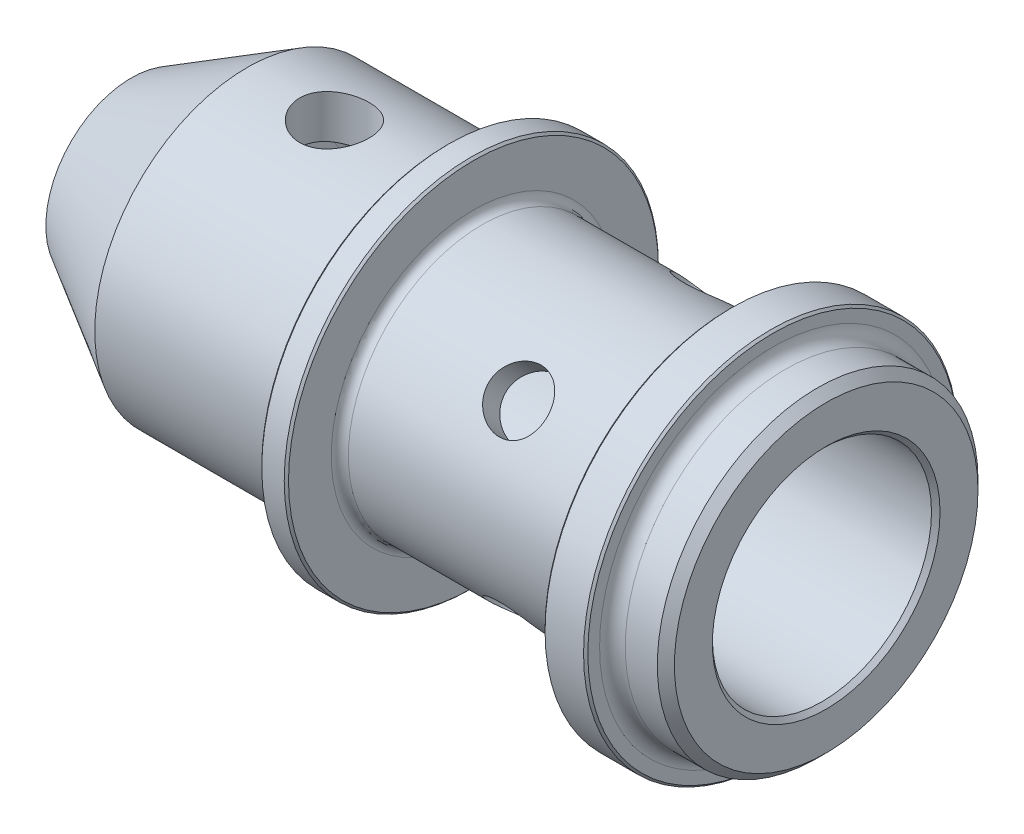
ISO-10303-21;
HEADER;
FILE_DESCRIPTION(('STEP AP214'),'2;1');
FILE_NAME('part.step','',(''),(''),'','','');
FILE_SCHEMA(('AUTOMOTIVE_DESIGN { 1 0 10303 214 1 1 1 1 }'));
ENDSEC;
DATA;
#1=APPLICATION_CONTEXT('core data for automotive mechanical design processes');
#2=APPLICATION_PROTOCOL_DEFINITION('international standard','automotive_design',2000,#1);
#3=PRODUCT_CONTEXT('',#1,'mechanical');
#4=PRODUCT('Part','Part','',(#3));
#5=PRODUCT_RELATED_PRODUCT_CATEGORY('part','',(#4));
#6=PRODUCT_DEFINITION_FORMATION('','',#4);
#7=PRODUCT_DEFINITION_CONTEXT('part definition',#1,'design');
#8=PRODUCT_DEFINITION('design','',#6,#7);
#9=PRODUCT_DEFINITION_SHAPE('','',#8);
#10=(LENGTH_UNIT() NAMED_UNIT(*) SI_UNIT(.MILLI.,.METRE.));
#11=(NAMED_UNIT(*) PLANE_ANGLE_UNIT() SI_UNIT($,.RADIAN.));
#12=(NAMED_UNIT(*) SI_UNIT($,.STERADIAN.) SOLID_ANGLE_UNIT());
#13=UNCERTAINTY_MEASURE_WITH_UNIT(LENGTH_MEASURE(1.E-05),#10,'distance_accuracy_value','');
#14=(GEOMETRIC_REPRESENTATION_CONTEXT(3) GLOBAL_UNCERTAINTY_ASSIGNED_CONTEXT((#13)) GLOBAL_UNIT_ASSIGNED_CONTEXT((#10,
#11,#12)) REPRESENTATION_CONTEXT('',''));
#15=CARTESIAN_POINT('',(0.,0.,0.));
#16=DIRECTION('',(0.,0.,1.));
#17=DIRECTION('',(1.,0.,0.));
#18=AXIS2_PLACEMENT_3D('',#15,#16,#17);
#19=CARTESIAN_POINT('',(0.,8.,0.));
#20=DIRECTION('',(-1.,0.,0.));
#21=DIRECTION('',(0.,0.,1.));
#22=AXIS2_PLACEMENT_3D('',#19,#20,#21);
#23=PLANE('',#22);
#24=CARTESIAN_POINT('',(0.,0.,0.));
#25=DIRECTION('',(-1.,0.,0.));
#26=DIRECTION('',(0.,0.,1.));
#27=AXIS2_PLACEMENT_3D('',#24,#25,#26);
#28=CIRCLE('',#27,3.6);
#29=CARTESIAN_POINT('',(0.,0.,3.6));
#30=VERTEX_POINT('',#29);
#31=EDGE_CURVE('E189',#30,#30,#28,.T.);
#32=ORIENTED_EDGE('',*,*,#31,.F.);
#33=EDGE_LOOP('',(#32));
#34=FACE_BOUND('',#33,.T.);
#35=CARTESIAN_POINT('',(0.,0.,0.));
#36=DIRECTION('',(1.,0.,0.));
#37=DIRECTION('',(0.,0.,-1.));
#38=AXIS2_PLACEMENT_3D('',#35,#36,#37);
#39=CIRCLE('',#38,8.);
#40=CARTESIAN_POINT('',(0.,0.,-8.));
#41=VERTEX_POINT('',#40);
#42=EDGE_CURVE('E192',#41,#41,#39,.T.);
#43=ORIENTED_EDGE('',*,*,#42,.F.);
#44=EDGE_LOOP('',(#43));
#45=FACE_BOUND('',#44,.T.);
#46=ADVANCED_FACE('F37',(#34,#45),#23,.T.);
#47=CARTESIAN_POINT('',(65.,0.,0.));
#48=DIRECTION('',(1.,0.,0.));
#49=DIRECTION('',(0.,0.,-1.));
#50=AXIS2_PLACEMENT_3D('',#47,#48,#49);
#51=PLANE('',#50);
#52=CARTESIAN_POINT('',(65.,0.,0.));
#53=DIRECTION('',(1.,0.,0.));
#54=DIRECTION('',(0.,0.,-1.));
#55=AXIS2_PLACEMENT_3D('',#52,#53,#54);
#56=CIRCLE('',#55,10.65);
#57=CARTESIAN_POINT('',(65.,0.,-10.65));
#58=VERTEX_POINT('',#57);
#59=EDGE_CURVE('E10',#58,#58,#56,.F.);
#60=ORIENTED_EDGE('',*,*,#59,.T.);
#61=EDGE_LOOP('',(#60));
#62=FACE_BOUND('',#61,.T.);
#63=CARTESIAN_POINT('',(65.,0.,0.));
#64=DIRECTION('',(1.,0.,0.));
#65=DIRECTION('',(0.,0.,-1.));
#66=AXIS2_PLACEMENT_3D('',#63,#64,#65);
#67=CIRCLE('',#66,14.2);
#68=CARTESIAN_POINT('',(65.,0.,-14.2));
#69=VERTEX_POINT('',#68);
#70=EDGE_CURVE('E78',#69,#69,#67,.T.);
#71=ORIENTED_EDGE('',*,*,#70,.T.);
#72=EDGE_LOOP('',(#71));
#73=FACE_BOUND('',#72,.T.);
#74=ADVANCED_FACE('F225',(#62,#73),#51,.T.);
#75=CARTESIAN_POINT('',(0.,0.,0.));
#76=DIRECTION('',(1.,0.,0.));
#77=DIRECTION('',(0.,0.,-1.));
#78=AXIS2_PLACEMENT_3D('',#75,#76,#77);
#79=CYLINDRICAL_SURFACE('',#78,15.);
#80=CARTESIAN_POINT('',(64.2,0.,0.));
#81=DIRECTION('',(1.,0.,0.));
#82=DIRECTION('',(0.,0.,-1.));
#83=AXIS2_PLACEMENT_3D('',#80,#81,#82);
#84=CIRCLE('',#83,15.);
#85=CARTESIAN_POINT('',(64.2,0.,-15.));
#86=VERTEX_POINT('',#85);
#87=EDGE_CURVE('E75',#86,#86,#84,.F.);
#88=ORIENTED_EDGE('',*,*,#87,.T.);
#89=EDGE_LOOP('',(#88));
#90=FACE_BOUND('',#89,.T.);
#91=CARTESIAN_POINT('',(61.2,0.,0.));
#92=DIRECTION('',(1.,0.,0.));
#93=DIRECTION('',(0.,0.,-1.));
#94=AXIS2_PLACEMENT_3D('',#91,#92,#93);
#95=CIRCLE('',#94,15.);
#96=CARTESIAN_POINT('',(61.2,0.,-15.));
#97=VERTEX_POINT('',#96);
#98=EDGE_CURVE('E98',#97,#97,#95,.T.);
#99=ORIENTED_EDGE('',*,*,#98,.T.);
#100=EDGE_LOOP('',(#99));
#101=FACE_BOUND('',#100,.T.);
#102=ADVANCED_FACE('F231',(#90,#101),#79,.T.);
#103=CARTESIAN_POINT('',(60.,15.,0.));
#104=DIRECTION('',(1.,0.,0.));
#105=DIRECTION('',(0.,0.,-1.));
#106=AXIS2_PLACEMENT_3D('',#103,#104,#105);
#107=PLANE('',#106);
#108=CARTESIAN_POINT('',(60.,0.,0.));
#109=DIRECTION('',(1.,0.,0.));
#110=DIRECTION('',(0.,0.,-1.));
#111=AXIS2_PLACEMENT_3D('',#108,#109,#110);
#112=CIRCLE('',#111,17.3);
#113=CARTESIAN_POINT('',(60.,0.,-17.3));
#114=VERTEX_POINT('',#113);
#115=EDGE_CURVE('E72',#114,#114,#112,.T.);
#116=ORIENTED_EDGE('',*,*,#115,.T.);
#117=EDGE_LOOP('',(#116));
#118=FACE_BOUND('',#117,.T.);
#119=CARTESIAN_POINT('',(60.,0.,0.));
#120=DIRECTION('',(1.,0.,0.));
#121=DIRECTION('',(0.,0.,-1.));
#122=AXIS2_PLACEMENT_3D('',#119,#120,#121);
#123=CIRCLE('',#122,16.2);
#124=CARTESIAN_POINT('',(60.,0.,-16.2));
#125=VERTEX_POINT('',#124);
#126=EDGE_CURVE('E95',#125,#125,#123,.F.);
#127=ORIENTED_EDGE('',*,*,#126,.T.);
#128=EDGE_LOOP('',(#127));
#129=FACE_BOUND('',#128,.T.);
#130=ADVANCED_FACE('F373',(#118,#129),#107,.T.);
#131=CARTESIAN_POINT('',(0.,0.,0.));
#132=DIRECTION('',(1.,0.,0.));
#133=DIRECTION('',(0.,0.,-1.));
#134=AXIS2_PLACEMENT_3D('',#131,#132,#133);
#135=CYLINDRICAL_SURFACE('',#134,17.5);
#136=CARTESIAN_POINT('',(59.8,0.,0.));
#137=DIRECTION('',(1.,0.,0.));
#138=DIRECTION('',(0.,0.,-1.));
#139=AXIS2_PLACEMENT_3D('',#136,#137,#138);
#140=CIRCLE('',#139,17.5);
#141=CARTESIAN_POINT('',(59.8,0.,-17.5));
#142=VERTEX_POINT('',#141);
#143=EDGE_CURVE('E66',#142,#142,#140,.F.);
#144=ORIENTED_EDGE('',*,*,#143,.T.);
#145=EDGE_LOOP('',(#144));
#146=FACE_BOUND('',#145,.T.);
#147=CARTESIAN_POINT('',(56.2,0.,0.));
#148=DIRECTION('',(-1.,0.,0.));
#149=DIRECTION('',(0.,0.,1.));
#150=AXIS2_PLACEMENT_3D('',#147,#148,#149);
#151=CIRCLE('',#150,17.5);
#152=CARTESIAN_POINT('',(56.2,0.,17.5));
#153=VERTEX_POINT('',#152);
#154=EDGE_CURVE('E69',#153,#153,#151,.F.);
#155=ORIENTED_EDGE('',*,*,#154,.T.);
#156=EDGE_LOOP('',(#155));
#157=FACE_BOUND('',#156,.T.);
#158=ADVANCED_FACE('F364',(#146,#157),#135,.T.);
#159=CARTESIAN_POINT('',(56.,17.5,0.));
#160=DIRECTION('',(-1.,0.,0.));
#161=DIRECTION('',(0.,0.,1.));
#162=AXIS2_PLACEMENT_3D('',#159,#160,#161);
#163=PLANE('',#162);
#164=CARTESIAN_POINT('',(56.,0.,0.));
#165=DIRECTION('',(-1.,0.,0.));
#166=DIRECTION('',(0.,0.,1.));
#167=AXIS2_PLACEMENT_3D('',#164,#165,#166);
#168=CIRCLE('',#167,17.3);
#169=CARTESIAN_POINT('',(56.,0.,17.3));
#170=VERTEX_POINT('',#169);
#171=EDGE_CURVE('E63',#170,#170,#168,.T.);
#172=ORIENTED_EDGE('',*,*,#171,.T.);
#173=EDGE_LOOP('',(#172));
#174=FACE_BOUND('',#173,.T.);
#175=CARTESIAN_POINT('',(56.,0.,0.));
#176=DIRECTION('',(-1.,0.,0.));
#177=DIRECTION('',(0.,0.,1.));
#178=AXIS2_PLACEMENT_3D('',#175,#176,#177);
#179=CIRCLE('',#178,13.7);
#180=CARTESIAN_POINT('',(56.,0.,13.7));
#181=VERTEX_POINT('',#180);
#182=EDGE_CURVE('E104',#181,#181,#179,.F.);
#183=ORIENTED_EDGE('',*,*,#182,.T.);
#184=EDGE_LOOP('',(#183));
#185=FACE_BOUND('',#184,.T.);
#186=ADVANCED_FACE('F179',(#174,#185),#163,.T.);
#187=CARTESIAN_POINT('',(0.,0.,0.));
#188=DIRECTION('',(1.,0.,0.));
#189=DIRECTION('',(0.,0.,-1.));
#190=AXIS2_PLACEMENT_3D('',#187,#188,#189);
#191=CYLINDRICAL_SURFACE('',#190,12.5);
#192=CARTESIAN_POINT('',(45.0000000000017,-10.5668258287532,-6.6777385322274));
#193=CARTESIAN_POINT('',(44.8475504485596,-10.5668243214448,-6.67774439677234));
#194=CARTESIAN_POINT('',(44.6950384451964,-10.5598750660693,-6.68877650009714));
#195=CARTESIAN_POINT('',(44.3943532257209,-10.5321198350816,-6.73239152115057));
#196=CARTESIAN_POINT('',(44.2461832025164,-10.5113039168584,-6.76498990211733));
#197=CARTESIAN_POINT('',(43.9585749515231,-10.4559991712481,-6.85015612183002));
#198=CARTESIAN_POINT('',(43.8191272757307,-10.4215254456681,-6.90270190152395));
#199=CARTESIAN_POINT('',(43.5525307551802,-10.3391711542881,-7.02545220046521));
#200=CARTESIAN_POINT('',(43.4253816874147,-10.2912908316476,-7.09565639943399));
#201=CARTESIAN_POINT('',(43.1848170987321,-10.1816792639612,-7.25207850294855));
#202=CARTESIAN_POINT('',(43.0716423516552,-10.1197466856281,-7.33852567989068));
#203=CARTESIAN_POINT('',(42.8643482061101,-9.98309798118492,-7.52335967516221));
#204=CARTESIAN_POINT('',(42.7702302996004,-9.90838085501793,-7.62174742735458));
#205=CARTESIAN_POINT('',(42.6027678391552,-9.74629623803,-7.82796680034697));
#206=CARTESIAN_POINT('',(42.5296550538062,-9.65880256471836,-7.93588779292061));
#207=CARTESIAN_POINT('',(42.4077779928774,-9.47334002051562,-8.15638116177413));
#208=CARTESIAN_POINT('',(42.3590109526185,-9.37537234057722,-8.26895300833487));
#209=CARTESIAN_POINT('',(42.2879675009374,-9.17279895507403,-8.49306798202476));
#210=CARTESIAN_POINT('',(42.2652835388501,-9.0683230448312,-8.60459914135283));
#211=CARTESIAN_POINT('',(42.2457757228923,-8.85413285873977,-8.82484647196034));
#212=CARTESIAN_POINT('',(42.2489488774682,-8.74441919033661,-8.9335629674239));
#213=CARTESIAN_POINT('',(42.2807620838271,-8.52494196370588,-9.14319480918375));
#214=CARTESIAN_POINT('',(42.3089628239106,-8.41521177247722,-9.24421222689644));
#215=CARTESIAN_POINT('',(42.3893303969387,-8.19727224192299,-9.43800859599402));
#216=CARTESIAN_POINT('',(42.4414983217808,-8.08906297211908,-9.53078717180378));
#217=CARTESIAN_POINT('',(42.5687067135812,-7.87691550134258,-9.70687205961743));
#218=CARTESIAN_POINT('',(42.6439133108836,-7.77301476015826,-9.79010332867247));
#219=CARTESIAN_POINT('',(42.8149402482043,-7.57388428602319,-9.94495911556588));
#220=CARTESIAN_POINT('',(42.9107634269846,-7.4786557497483,-10.0165820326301));
#221=CARTESIAN_POINT('',(43.122693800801,-7.29839430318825,-10.1487049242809));
#222=CARTESIAN_POINT('',(43.2391854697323,-7.2136181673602,-10.2089390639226));
#223=CARTESIAN_POINT('',(43.4878904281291,-7.06001156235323,-10.3157654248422));
#224=CARTESIAN_POINT('',(43.6201041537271,-6.99118153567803,-10.3623572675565));
#225=CARTESIAN_POINT('',(43.8971024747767,-6.87223411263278,-10.4416256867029));
#226=CARTESIAN_POINT('',(44.0419239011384,-6.82217397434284,-10.4742597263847));
#227=CARTESIAN_POINT('',(44.3396728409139,-6.74341512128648,-10.525140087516));
#228=CARTESIAN_POINT('',(44.4925990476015,-6.71471297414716,-10.5433887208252));
#229=CARTESIAN_POINT('',(44.7988379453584,-6.68044906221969,-10.5651316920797));
#230=CARTESIAN_POINT('',(44.9520776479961,-6.67442235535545,-10.5689224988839));
#231=CARTESIAN_POINT('',(45.2575248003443,-6.68451677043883,-10.5625409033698));
#232=CARTESIAN_POINT('',(45.4097323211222,-6.70063635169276,-10.5523694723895));
#233=CARTESIAN_POINT('',(45.7069150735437,-6.75390504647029,-10.5183523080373));
#234=CARTESIAN_POINT('',(45.851955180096,-6.79079945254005,-10.4946721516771));
#235=CARTESIAN_POINT('',(46.1327999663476,-6.88374557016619,-10.4339402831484));
#236=CARTESIAN_POINT('',(46.268603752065,-6.93979913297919,-10.3968872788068));
#237=CARTESIAN_POINT('',(46.5294489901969,-7.06969356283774,-10.3090083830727));
#238=CARTESIAN_POINT('',(46.6542901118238,-7.143797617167,-10.2579771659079));
#239=CARTESIAN_POINT('',(46.8875495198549,-7.3063348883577,-10.1428480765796));
#240=CARTESIAN_POINT('',(46.9959657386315,-7.39476990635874,-10.0787485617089));
#241=CARTESIAN_POINT('',(47.1953910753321,-7.58443483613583,-9.93683109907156));
#242=CARTESIAN_POINT('',(47.286032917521,-7.68587478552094,-9.85877700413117));
#243=CARTESIAN_POINT('',(47.444708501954,-7.89644809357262,-9.69093434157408));
#244=CARTESIAN_POINT('',(47.5127433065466,-8.00558109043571,-9.6011463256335));
#245=CARTESIAN_POINT('',(47.6237638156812,-8.22694909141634,-9.41213758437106));
#246=CARTESIAN_POINT('',(47.6669092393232,-8.33915936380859,-9.31298186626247));
#247=CARTESIAN_POINT('',(47.7274244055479,-8.56355135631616,-9.10707161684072));
#248=CARTESIAN_POINT('',(47.7447979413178,-8.67573307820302,-9.0003182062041));
#249=CARTESIAN_POINT('',(47.7531039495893,-8.89417348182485,-8.78446162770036));
#250=CARTESIAN_POINT('',(47.744584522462,-9.00050709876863,-8.67545501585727));
#251=CARTESIAN_POINT('',(47.7025735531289,-9.20678496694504,-8.45622661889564));
#252=CARTESIAN_POINT('',(47.6690824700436,-9.30672933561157,-8.34600485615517));
#253=CARTESIAN_POINT('',(47.5783428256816,-9.49752593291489,-8.12821694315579));
#254=CARTESIAN_POINT('',(47.5211728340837,-9.58840700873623,-8.02064324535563));
#255=CARTESIAN_POINT('',(47.3847745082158,-9.75970170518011,-7.81130828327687));
#256=CARTESIAN_POINT('',(47.3055440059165,-9.84011429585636,-7.70954759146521));
#257=CARTESIAN_POINT('',(47.1254909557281,-9.99068324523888,-7.51344407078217));
#258=CARTESIAN_POINT('',(47.0242834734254,-10.0606133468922,-7.41928091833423));
#259=CARTESIAN_POINT('',(46.8039247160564,-10.1875033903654,-7.24406687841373));
#260=CARTESIAN_POINT('',(46.6847691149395,-10.2444601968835,-7.16301916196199));
#261=CARTESIAN_POINT('',(46.4299529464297,-10.3455288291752,-7.01627397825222));
#262=CARTESIAN_POINT('',(46.2940904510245,-10.3894559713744,-6.95079960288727));
#263=CARTESIAN_POINT('',(46.0109864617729,-10.4630163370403,-6.8395737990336));
#264=CARTESIAN_POINT('',(45.8637546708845,-10.4926615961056,-6.79380576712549));
#265=CARTESIAN_POINT('',(45.5969893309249,-10.5322925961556,-6.73214726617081));
#266=CARTESIAN_POINT('',(45.4788969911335,-10.545235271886,-6.71180098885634));
#267=CARTESIAN_POINT('',(45.240549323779,-10.5625022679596,-6.68459464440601));
#268=CARTESIAN_POINT('',(45.1202941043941,-10.5668270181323,-6.67773390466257));
#269=CARTESIAN_POINT('',(45.0000000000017,-10.5668258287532,-6.6777385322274));
#270=B_SPLINE_CURVE_WITH_KNOTS('',3,(#192,#193,#194,#195,#196,#197,#198,#199,#200,#201,#202,
#203,#204,#205,#206,#207,#208,#209,#210,#211,#212,#213,#214,#215,#216,#217,#218,#219,#220,#221,
#222,#223,#224,#225,#226,#227,#228,#229,#230,#231,#232,#233,#234,#235,#236,#237,#238,#239,#240,
#241,#242,#243,#244,#245,#246,#247,#248,#249,#250,#251,#252,#253,#254,#255,#256,#257,#258,#259,
#260,#261,#262,#263,#264,#265,#266,#267,#268,#269),.UNSPECIFIED.,.T.,.F.,(4,2,2,2,2,2,2,2,2,2,2,
2,2,2,2,2,2,2,2,2,2,2,2,2,2,2,2,2,2,2,2,2,2,2,2,2,2,2,4),(0.,0.456907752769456,0.91414346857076,
1.37087501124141,1.82759827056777,2.29133235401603,2.75510272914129,3.22380935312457,
3.69246273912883,4.15368936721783,4.61486263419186,5.06809754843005,5.52135311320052,
5.97795723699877,6.4346242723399,6.90090287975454,7.36719442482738,7.83489705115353,
8.3025244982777,8.76050965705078,9.21846295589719,9.67092013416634,10.1234210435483,
10.5829625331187,11.0425618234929,11.5108380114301,11.9790921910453,12.4443070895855,
12.9094535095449,13.3648228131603,13.8201837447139,14.274045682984,14.7279522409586,
15.190563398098,15.6532862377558,16.1222846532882,16.5908871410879,16.9514395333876,
17.3119739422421),.UNSPECIFIED.);
#271=CARTESIAN_POINT('',(45.0000000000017,-10.5668258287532,-6.6777385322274));
#272=VERTEX_POINT('',#271);
#273=EDGE_CURVE('E554',#272,#272,#270,.T.);
#274=ORIENTED_EDGE('',*,*,#273,.F.);
#275=EDGE_LOOP('',(#274));
#276=FACE_BOUND('',#275,.T.);
#277=CARTESIAN_POINT('',(45.0000000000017,-6.67773853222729,10.5668258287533));
#278=CARTESIAN_POINT('',(44.8475504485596,-6.67774439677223,10.5668243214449));
#279=CARTESIAN_POINT('',(44.6950384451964,-6.68877650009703,10.5598750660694));
#280=CARTESIAN_POINT('',(44.3943532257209,-6.73239152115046,10.5321198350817));
#281=CARTESIAN_POINT('',(44.2461832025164,-6.76498990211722,10.5113039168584));
#282=CARTESIAN_POINT('',(43.9585749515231,-6.85015612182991,10.4559991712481));
#283=CARTESIAN_POINT('',(43.8191272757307,-6.90270190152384,10.4215254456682));
#284=CARTESIAN_POINT('',(43.5525307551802,-7.0254522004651,10.3391711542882));
#285=CARTESIAN_POINT('',(43.4253816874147,-7.09565639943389,10.2912908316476));
#286=CARTESIAN_POINT('',(43.1848170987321,-7.25207850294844,10.1816792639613));
#287=CARTESIAN_POINT('',(43.0716423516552,-7.33852567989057,10.1197466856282));
#288=CARTESIAN_POINT('',(42.8643482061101,-7.52335967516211,9.983097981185));
#289=CARTESIAN_POINT('',(42.7702302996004,-7.62174742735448,9.90838085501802));
#290=CARTESIAN_POINT('',(42.6027678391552,-7.82796680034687,9.74629623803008));
#291=CARTESIAN_POINT('',(42.5296550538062,-7.93588779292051,9.65880256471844));
#292=CARTESIAN_POINT('',(42.4077779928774,-8.15638116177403,9.4733400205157));
#293=CARTESIAN_POINT('',(42.3590109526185,-8.26895300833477,9.37537234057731));
#294=CARTESIAN_POINT('',(42.2879675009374,-8.49306798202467,9.17279895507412));
#295=CARTESIAN_POINT('',(42.2652835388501,-8.60459914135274,9.0683230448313));
#296=CARTESIAN_POINT('',(42.2457757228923,-8.82484647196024,8.85413285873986));
#297=CARTESIAN_POINT('',(42.2489488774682,-8.93356296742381,8.74441919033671));
#298=CARTESIAN_POINT('',(42.2807620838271,-9.14319480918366,8.52494196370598));
#299=CARTESIAN_POINT('',(42.3089628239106,-9.24421222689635,8.41521177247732));
#300=CARTESIAN_POINT('',(42.3893303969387,-9.43800859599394,8.19727224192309));
#301=CARTESIAN_POINT('',(42.4414983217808,-9.5307871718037,8.08906297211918));
#302=CARTESIAN_POINT('',(42.5687067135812,-9.70687205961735,7.87691550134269));
#303=CARTESIAN_POINT('',(42.6439133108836,-9.79010332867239,7.77301476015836));
#304=CARTESIAN_POINT('',(42.8149402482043,-9.9449591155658,7.5738842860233));
#305=CARTESIAN_POINT('',(42.9107634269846,-10.01658203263,7.4786557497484));
#306=CARTESIAN_POINT('',(43.122693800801,-10.1487049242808,7.29839430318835));
#307=CARTESIAN_POINT('',(43.2391854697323,-10.2089390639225,7.2136181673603));
#308=CARTESIAN_POINT('',(43.4878904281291,-10.3157654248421,7.06001156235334));
#309=CARTESIAN_POINT('',(43.6201041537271,-10.3623572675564,6.99118153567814));
#310=CARTESIAN_POINT('',(43.8971024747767,-10.4416256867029,6.87223411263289));
#311=CARTESIAN_POINT('',(44.0419239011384,-10.4742597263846,6.82217397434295));
#312=CARTESIAN_POINT('',(44.3396728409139,-10.525140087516,6.7434151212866));
#313=CARTESIAN_POINT('',(44.4925990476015,-10.5433887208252,6.71471297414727));
#314=CARTESIAN_POINT('',(44.7988379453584,-10.5651316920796,6.6804490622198));
#315=CARTESIAN_POINT('',(44.9520776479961,-10.5689224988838,6.67442235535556));
#316=CARTESIAN_POINT('',(45.2575248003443,-10.5625409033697,6.68451677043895));
#317=CARTESIAN_POINT('',(45.4097323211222,-10.5523694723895,6.70063635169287));
#318=CARTESIAN_POINT('',(45.7069150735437,-10.5183523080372,6.7539050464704));
#319=CARTESIAN_POINT('',(45.851955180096,-10.4946721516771,6.79079945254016));
#320=CARTESIAN_POINT('',(46.1327999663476,-10.4339402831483,6.8837455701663));
#321=CARTESIAN_POINT('',(46.268603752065,-10.3968872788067,6.9397991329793));
#322=CARTESIAN_POINT('',(46.5294489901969,-10.3090083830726,7.06969356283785));
#323=CARTESIAN_POINT('',(46.6542901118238,-10.2579771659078,7.14379761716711));
#324=CARTESIAN_POINT('',(46.8875495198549,-10.1428480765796,7.30633488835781));
#325=CARTESIAN_POINT('',(46.9959657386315,-10.0787485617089,7.39476990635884));
#326=CARTESIAN_POINT('',(47.1953910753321,-9.93683109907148,7.58443483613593));
#327=CARTESIAN_POINT('',(47.286032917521,-9.85877700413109,7.68587478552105));
#328=CARTESIAN_POINT('',(47.444708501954,-9.690934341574,7.89644809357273));
#329=CARTESIAN_POINT('',(47.5127433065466,-9.60114632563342,8.00558109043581));
#330=CARTESIAN_POINT('',(47.6237638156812,-9.41213758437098,8.22694909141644));
#331=CARTESIAN_POINT('',(47.6669092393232,-9.31298186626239,8.33915936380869));
#332=CARTESIAN_POINT('',(47.7274244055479,-9.10707161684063,8.56355135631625));
#333=CARTESIAN_POINT('',(47.7447979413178,-9.00031820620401,8.67573307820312));
#334=CARTESIAN_POINT('',(47.7531039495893,-8.78446162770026,8.89417348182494));
#335=CARTESIAN_POINT('',(47.744584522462,-8.67545501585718,9.00050709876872));
#336=CARTESIAN_POINT('',(47.7025735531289,-8.45622661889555,9.20678496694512));
#337=CARTESIAN_POINT('',(47.6690824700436,-8.34600485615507,9.30672933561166));
#338=CARTESIAN_POINT('',(47.5783428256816,-8.12821694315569,9.49752593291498));
#339=CARTESIAN_POINT('',(47.5211728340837,-8.02064324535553,9.58840700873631));
#340=CARTESIAN_POINT('',(47.3847745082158,-7.81130828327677,9.75970170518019));
#341=CARTESIAN_POINT('',(47.3055440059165,-7.7095475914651,9.84011429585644));
#342=CARTESIAN_POINT('',(47.1254909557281,-7.51344407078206,9.99068324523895));
#343=CARTESIAN_POINT('',(47.0242834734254,-7.41928091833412,10.0606133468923));
#344=CARTESIAN_POINT('',(46.8039247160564,-7.24406687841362,10.1875033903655));
#345=CARTESIAN_POINT('',(46.6847691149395,-7.16301916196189,10.2444601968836));
#346=CARTESIAN_POINT('',(46.4299529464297,-7.01627397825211,10.3455288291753));
#347=CARTESIAN_POINT('',(46.2940904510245,-6.95079960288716,10.3894559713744));
#348=CARTESIAN_POINT('',(46.0109864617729,-6.83957379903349,10.4630163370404));
#349=CARTESIAN_POINT('',(45.8637546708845,-6.79380576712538,10.4926615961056));
#350=CARTESIAN_POINT('',(45.5969893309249,-6.7321472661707,10.5322925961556));
#351=CARTESIAN_POINT('',(45.4788969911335,-6.71180098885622,10.5452352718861));
#352=CARTESIAN_POINT('',(45.240549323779,-6.68459464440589,10.5625022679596));
#353=CARTESIAN_POINT('',(45.1202941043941,-6.67773390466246,10.5668270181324));
#354=CARTESIAN_POINT('',(45.0000000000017,-6.67773853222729,10.5668258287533));
#355=B_SPLINE_CURVE_WITH_KNOTS('',3,(#277,#278,#279,#280,#281,#282,#283,#284,#285,#286,#287,
#288,#289,#290,#291,#292,#293,#294,#295,#296,#297,#298,#299,#300,#301,#302,#303,#304,#305,#306,
#307,#308,#309,#310,#311,#312,#313,#314,#315,#316,#317,#318,#319,#320,#321,#322,#323,#324,#325,
#326,#327,#328,#329,#330,#331,#332,#333,#334,#335,#336,#337,#338,#339,#340,#341,#342,#343,#344,
#345,#346,#347,#348,#349,#350,#351,#352,#353,#354),.UNSPECIFIED.,.T.,.F.,(4,2,2,2,2,2,2,2,2,2,2,
2,2,2,2,2,2,2,2,2,2,2,2,2,2,2,2,2,2,2,2,2,2,2,2,2,2,2,4),(0.,0.456907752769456,0.91414346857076,
1.37087501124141,1.82759827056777,2.29133235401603,2.75510272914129,3.22380935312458,
3.69246273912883,4.15368936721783,4.61486263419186,5.06809754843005,5.52135311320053,
5.97795723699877,6.4346242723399,6.90090287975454,7.36719442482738,7.83489705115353,
8.3025244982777,8.76050965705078,9.21846295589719,9.67092013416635,10.1234210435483,
10.5829625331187,11.0425618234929,11.5108380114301,11.9790921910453,12.4443070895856,
12.9094535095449,13.3648228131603,13.8201837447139,14.274045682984,14.7279522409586,
15.190563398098,15.6532862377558,16.1222846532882,16.5908871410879,16.9514395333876,
17.3119739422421),.UNSPECIFIED.);
#356=CARTESIAN_POINT('',(45.0000000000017,-6.67773853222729,10.5668258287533));
#357=VERTEX_POINT('',#356);
#358=EDGE_CURVE('E529',#357,#357,#355,.T.);
#359=ORIENTED_EDGE('',*,*,#358,.F.);
#360=EDGE_LOOP('',(#359));
#361=FACE_BOUND('',#360,.T.);
#362=CARTESIAN_POINT('',(45.0000000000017,10.5668258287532,6.67773853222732));
#363=CARTESIAN_POINT('',(44.8475504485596,10.5668243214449,6.67774439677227));
#364=CARTESIAN_POINT('',(44.6950384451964,10.5598750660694,6.68877650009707));
#365=CARTESIAN_POINT('',(44.3943532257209,10.5321198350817,6.7323915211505));
#366=CARTESIAN_POINT('',(44.2461832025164,10.5113039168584,6.76498990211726));
#367=CARTESIAN_POINT('',(43.9585749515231,10.4559991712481,6.85015612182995));
#368=CARTESIAN_POINT('',(43.8191272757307,10.4215254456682,6.90270190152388));
#369=CARTESIAN_POINT('',(43.5525307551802,10.3391711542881,7.02545220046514));
#370=CARTESIAN_POINT('',(43.4253816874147,10.2912908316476,7.09565639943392));
#371=CARTESIAN_POINT('',(43.1848170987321,10.1816792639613,7.25207850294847));
#372=CARTESIAN_POINT('',(43.0716423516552,10.1197466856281,7.33852567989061));
#373=CARTESIAN_POINT('',(42.8643482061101,9.98309798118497,7.52335967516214));
#374=CARTESIAN_POINT('',(42.7702302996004,9.90838085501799,7.62174742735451));
#375=CARTESIAN_POINT('',(42.6027678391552,9.74629623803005,7.8279668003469));
#376=CARTESIAN_POINT('',(42.5296550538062,9.65880256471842,7.93588779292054));
#377=CARTESIAN_POINT('',(42.4077779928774,9.47334002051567,8.15638116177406));
#378=CARTESIAN_POINT('',(42.3590109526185,9.37537234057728,8.26895300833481));
#379=CARTESIAN_POINT('',(42.2879675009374,9.17279895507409,8.4930679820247));
#380=CARTESIAN_POINT('',(42.2652835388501,9.06832304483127,8.60459914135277));
#381=CARTESIAN_POINT('',(42.2457757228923,8.85413285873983,8.82484647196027));
#382=CARTESIAN_POINT('',(42.2489488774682,8.74441919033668,8.93356296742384));
#383=CARTESIAN_POINT('',(42.2807620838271,8.52494196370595,9.14319480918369));
#384=CARTESIAN_POINT('',(42.3089628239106,8.41521177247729,9.24421222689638));
#385=CARTESIAN_POINT('',(42.3893303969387,8.19727224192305,9.43800859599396));
#386=CARTESIAN_POINT('',(42.4414983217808,8.08906297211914,9.53078717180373));
#387=CARTESIAN_POINT('',(42.5687067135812,7.87691550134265,9.70687205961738));
#388=CARTESIAN_POINT('',(42.6439133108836,7.77301476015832,9.79010332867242));
#389=CARTESIAN_POINT('',(42.8149402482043,7.57388428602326,9.94495911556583));
#390=CARTESIAN_POINT('',(42.9107634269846,7.47865574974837,10.01658203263));
#391=CARTESIAN_POINT('',(43.122693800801,7.29839430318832,10.1487049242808));
#392=CARTESIAN_POINT('',(43.2391854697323,7.21361816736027,10.2089390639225));
#393=CARTESIAN_POINT('',(43.4878904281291,7.0600115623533,10.3157654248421));
#394=CARTESIAN_POINT('',(43.6201041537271,6.99118153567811,10.3623572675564));
#395=CARTESIAN_POINT('',(43.8971024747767,6.87223411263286,10.4416256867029));
#396=CARTESIAN_POINT('',(44.0419239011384,6.82217397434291,10.4742597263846));
#397=CARTESIAN_POINT('',(44.3396728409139,6.74341512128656,10.525140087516));
#398=CARTESIAN_POINT('',(44.4925990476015,6.71471297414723,10.5433887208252));
#399=CARTESIAN_POINT('',(44.7988379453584,6.68044906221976,10.5651316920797));
#400=CARTESIAN_POINT('',(44.9520776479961,6.67442235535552,10.5689224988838));
#401=CARTESIAN_POINT('',(45.2575248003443,6.68451677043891,10.5625409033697));
#402=CARTESIAN_POINT('',(45.4097323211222,6.70063635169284,10.5523694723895));
#403=CARTESIAN_POINT('',(45.7069150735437,6.75390504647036,10.5183523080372));
#404=CARTESIAN_POINT('',(45.851955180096,6.79079945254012,10.4946721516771));
#405=CARTESIAN_POINT('',(46.1327999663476,6.88374557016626,10.4339402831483));
#406=CARTESIAN_POINT('',(46.268603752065,6.93979913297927,10.3968872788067));
#407=CARTESIAN_POINT('',(46.5294489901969,7.06969356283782,10.3090083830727));
#408=CARTESIAN_POINT('',(46.6542901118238,7.14379761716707,10.2579771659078));
#409=CARTESIAN_POINT('',(46.8875495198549,7.30633488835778,10.1428480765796));
#410=CARTESIAN_POINT('',(46.9959657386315,7.39476990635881,10.0787485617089));
#411=CARTESIAN_POINT('',(47.1953910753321,7.5844348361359,9.93683109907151));
#412=CARTESIAN_POINT('',(47.286032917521,7.68587478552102,9.85877700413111));
#413=CARTESIAN_POINT('',(47.444708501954,7.89644809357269,9.69093434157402));
#414=CARTESIAN_POINT('',(47.5127433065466,8.00558109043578,9.60114632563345));
#415=CARTESIAN_POINT('',(47.6237638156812,8.2269490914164,9.41213758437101));
#416=CARTESIAN_POINT('',(47.6669092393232,8.33915936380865,9.31298186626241));
#417=CARTESIAN_POINT('',(47.7274244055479,8.56355135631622,9.10707161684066));
#418=CARTESIAN_POINT('',(47.7447979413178,8.67573307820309,9.00031820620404));
#419=CARTESIAN_POINT('',(47.7531039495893,8.89417348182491,8.7844616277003));
#420=CARTESIAN_POINT('',(47.744584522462,9.00050709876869,8.67545501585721));
#421=CARTESIAN_POINT('',(47.7025735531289,9.20678496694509,8.45622661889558));
#422=CARTESIAN_POINT('',(47.6690824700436,9.30672933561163,8.34600485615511));
#423=CARTESIAN_POINT('',(47.5783428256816,9.49752593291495,8.12821694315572));
#424=CARTESIAN_POINT('',(47.5211728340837,9.58840700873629,8.02064324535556));
#425=CARTESIAN_POINT('',(47.3847745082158,9.75970170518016,7.8113082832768));
#426=CARTESIAN_POINT('',(47.3055440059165,9.84011429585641,7.70954759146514));
#427=CARTESIAN_POINT('',(47.1254909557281,9.99068324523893,7.5134440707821));
#428=CARTESIAN_POINT('',(47.0242834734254,10.0606133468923,7.41928091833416));
#429=CARTESIAN_POINT('',(46.8039247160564,10.1875033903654,7.24406687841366));
#430=CARTESIAN_POINT('',(46.6847691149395,10.2444601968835,7.16301916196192));
#431=CARTESIAN_POINT('',(46.4299529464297,10.3455288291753,7.01627397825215));
#432=CARTESIAN_POINT('',(46.2940904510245,10.3894559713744,6.9507996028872));
#433=CARTESIAN_POINT('',(46.0109864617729,10.4630163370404,6.83957379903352));
#434=CARTESIAN_POINT('',(45.8637546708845,10.4926615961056,6.79380576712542));
#435=CARTESIAN_POINT('',(45.5969893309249,10.5322925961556,6.73214726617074));
#436=CARTESIAN_POINT('',(45.4788969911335,10.5452352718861,6.71180098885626));
#437=CARTESIAN_POINT('',(45.240549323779,10.5625022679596,6.68459464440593));
#438=CARTESIAN_POINT('',(45.1202941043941,10.5668270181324,6.6777339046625));
#439=CARTESIAN_POINT('',(45.0000000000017,10.5668258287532,6.67773853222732));
#440=B_SPLINE_CURVE_WITH_KNOTS('',3,(#362,#363,#364,#365,#366,#367,#368,#369,#370,#371,#372,
#373,#374,#375,#376,#377,#378,#379,#380,#381,#382,#383,#384,#385,#386,#387,#388,#389,#390,#391,
#392,#393,#394,#395,#396,#397,#398,#399,#400,#401,#402,#403,#404,#405,#406,#407,#408,#409,#410,
#411,#412,#413,#414,#415,#416,#417,#418,#419,#420,#421,#422,#423,#424,#425,#426,#427,#428,#429,
#430,#431,#432,#433,#434,#435,#436,#437,#438,#439),.UNSPECIFIED.,.T.,.F.,(4,2,2,2,2,2,2,2,2,2,2,
2,2,2,2,2,2,2,2,2,2,2,2,2,2,2,2,2,2,2,2,2,2,2,2,2,2,2,4),(0.,0.456907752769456,
0.914143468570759,1.37087501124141,1.82759827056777,2.29133235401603,2.75510272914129,
3.22380935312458,3.69246273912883,4.15368936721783,4.61486263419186,5.06809754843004,
5.52135311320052,5.97795723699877,6.4346242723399,6.90090287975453,7.36719442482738,
7.83489705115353,8.3025244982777,8.76050965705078,9.21846295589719,9.67092013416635,
10.1234210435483,10.5829625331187,11.0425618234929,11.5108380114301,11.9790921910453,
12.4443070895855,12.9094535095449,13.3648228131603,13.8201837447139,14.274045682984,
14.7279522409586,15.190563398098,15.6532862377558,16.1222846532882,16.5908871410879,
16.9514395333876,17.3119739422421),.UNSPECIFIED.);
#441=CARTESIAN_POINT('',(45.0000000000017,10.5668258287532,6.67773853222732));
#442=VERTEX_POINT('',#441);
#443=EDGE_CURVE('E522',#442,#442,#440,.T.);
#444=ORIENTED_EDGE('',*,*,#443,.F.);
#445=EDGE_LOOP('',(#444));
#446=FACE_BOUND('',#445,.T.);
#447=CARTESIAN_POINT('',(32.8,0.,0.));
#448=DIRECTION('',(1.,0.,0.));
#449=DIRECTION('',(0.,0.,-1.));
#450=AXIS2_PLACEMENT_3D('',#447,#448,#449);
#451=CIRCLE('',#450,12.5);
#452=CARTESIAN_POINT('',(32.8,0.,-12.5));
#453=VERTEX_POINT('',#452);
#454=EDGE_CURVE('E91',#453,#453,#451,.T.);
#455=ORIENTED_EDGE('',*,*,#454,.T.);
#456=EDGE_LOOP('',(#455));
#457=FACE_BOUND('',#456,.T.);
#458=CARTESIAN_POINT('',(54.8,0.,0.));
#459=DIRECTION('',(-1.,0.,0.));
#460=DIRECTION('',(0.,0.,1.));
#461=AXIS2_PLACEMENT_3D('',#458,#459,#460);
#462=CIRCLE('',#461,12.5);
#463=CARTESIAN_POINT('',(54.8,0.,12.5));
#464=VERTEX_POINT('',#463);
#465=EDGE_CURVE('E101',#464,#464,#462,.T.);
#466=ORIENTED_EDGE('',*,*,#465,.T.);
#467=EDGE_LOOP('',(#466));
#468=FACE_BOUND('',#467,.T.);
#469=CARTESIAN_POINT('',(45.0000000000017,6.67773853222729,-10.5668258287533));
#470=CARTESIAN_POINT('',(44.8475504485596,6.67774439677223,-10.5668243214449));
#471=CARTESIAN_POINT('',(44.6950384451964,6.68877650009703,-10.5598750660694));
#472=CARTESIAN_POINT('',(44.3943532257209,6.73239152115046,-10.5321198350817));
#473=CARTESIAN_POINT('',(44.2461832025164,6.76498990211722,-10.5113039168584));
#474=CARTESIAN_POINT('',(43.9585749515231,6.85015612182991,-10.4559991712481));
#475=CARTESIAN_POINT('',(43.8191272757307,6.90270190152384,-10.4215254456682));
#476=CARTESIAN_POINT('',(43.5525307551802,7.0254522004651,-10.3391711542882));
#477=CARTESIAN_POINT('',(43.4253816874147,7.09565639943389,-10.2912908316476));
#478=CARTESIAN_POINT('',(43.1848170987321,7.25207850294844,-10.1816792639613));
#479=CARTESIAN_POINT('',(43.0716423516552,7.33852567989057,-10.1197466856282));
#480=CARTESIAN_POINT('',(42.8643482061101,7.52335967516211,-9.983097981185));
#481=CARTESIAN_POINT('',(42.7702302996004,7.62174742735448,-9.90838085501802));
#482=CARTESIAN_POINT('',(42.6027678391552,7.82796680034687,-9.74629623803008));
#483=CARTESIAN_POINT('',(42.5296550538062,7.93588779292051,-9.65880256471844));
#484=CARTESIAN_POINT('',(42.4077779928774,8.15638116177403,-9.4733400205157));
#485=CARTESIAN_POINT('',(42.3590109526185,8.26895300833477,-9.37537234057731));
#486=CARTESIAN_POINT('',(42.2879675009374,8.49306798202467,-9.17279895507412));
#487=CARTESIAN_POINT('',(42.2652835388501,8.60459914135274,-9.0683230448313));
#488=CARTESIAN_POINT('',(42.2457757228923,8.82484647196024,-8.85413285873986));
#489=CARTESIAN_POINT('',(42.2489488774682,8.93356296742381,-8.74441919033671));
#490=CARTESIAN_POINT('',(42.2807620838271,9.14319480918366,-8.52494196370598));
#491=CARTESIAN_POINT('',(42.3089628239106,9.24421222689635,-8.41521177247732));
#492=CARTESIAN_POINT('',(42.3893303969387,9.43800859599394,-8.19727224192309));
#493=CARTESIAN_POINT('',(42.4414983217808,9.5307871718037,-8.08906297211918));
#494=CARTESIAN_POINT('',(42.5687067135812,9.70687205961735,-7.87691550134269));
#495=CARTESIAN_POINT('',(42.6439133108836,9.79010332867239,-7.77301476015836));
#496=CARTESIAN_POINT('',(42.8149402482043,9.9449591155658,-7.5738842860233));
#497=CARTESIAN_POINT('',(42.9107634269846,10.01658203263,-7.4786557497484));
#498=CARTESIAN_POINT('',(43.122693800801,10.1487049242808,-7.29839430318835));
#499=CARTESIAN_POINT('',(43.2391854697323,10.2089390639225,-7.2136181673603));
#500=CARTESIAN_POINT('',(43.4878904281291,10.3157654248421,-7.06001156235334));
#501=CARTESIAN_POINT('',(43.6201041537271,10.3623572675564,-6.99118153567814));
#502=CARTESIAN_POINT('',(43.8971024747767,10.4416256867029,-6.87223411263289));
#503=CARTESIAN_POINT('',(44.0419239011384,10.4742597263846,-6.82217397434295));
#504=CARTESIAN_POINT('',(44.3396728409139,10.525140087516,-6.7434151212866));
#505=CARTESIAN_POINT('',(44.4925990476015,10.5433887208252,-6.71471297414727));
#506=CARTESIAN_POINT('',(44.7988379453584,10.5651316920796,-6.6804490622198));
#507=CARTESIAN_POINT('',(44.9520776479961,10.5689224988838,-6.67442235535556));
#508=CARTESIAN_POINT('',(45.2575248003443,10.5625409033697,-6.68451677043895));
#509=CARTESIAN_POINT('',(45.4097323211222,10.5523694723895,-6.70063635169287));
#510=CARTESIAN_POINT('',(45.7069150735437,10.5183523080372,-6.7539050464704));
#511=CARTESIAN_POINT('',(45.851955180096,10.4946721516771,-6.79079945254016));
#512=CARTESIAN_POINT('',(46.1327999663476,10.4339402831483,-6.8837455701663));
#513=CARTESIAN_POINT('',(46.268603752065,10.3968872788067,-6.9397991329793));
#514=CARTESIAN_POINT('',(46.5294489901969,10.3090083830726,-7.06969356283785));
#515=CARTESIAN_POINT('',(46.6542901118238,10.2579771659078,-7.14379761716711));
#516=CARTESIAN_POINT('',(46.8875495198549,10.1428480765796,-7.30633488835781));
#517=CARTESIAN_POINT('',(46.9959657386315,10.0787485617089,-7.39476990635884));
#518=CARTESIAN_POINT('',(47.1953910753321,9.93683109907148,-7.58443483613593));
#519=CARTESIAN_POINT('',(47.286032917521,9.85877700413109,-7.68587478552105));
#520=CARTESIAN_POINT('',(47.444708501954,9.690934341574,-7.89644809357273));
#521=CARTESIAN_POINT('',(47.5127433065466,9.60114632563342,-8.00558109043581));
#522=CARTESIAN_POINT('',(47.6237638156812,9.41213758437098,-8.22694909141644));
#523=CARTESIAN_POINT('',(47.6669092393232,9.31298186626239,-8.33915936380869));
#524=CARTESIAN_POINT('',(47.7274244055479,9.10707161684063,-8.56355135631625));
#525=CARTESIAN_POINT('',(47.7447979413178,9.00031820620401,-8.67573307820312));
#526=CARTESIAN_POINT('',(47.7531039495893,8.78446162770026,-8.89417348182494));
#527=CARTESIAN_POINT('',(47.744584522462,8.67545501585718,-9.00050709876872));
#528=CARTESIAN_POINT('',(47.7025735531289,8.45622661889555,-9.20678496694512));
#529=CARTESIAN_POINT('',(47.6690824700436,8.34600485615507,-9.30672933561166));
#530=CARTESIAN_POINT('',(47.5783428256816,8.12821694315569,-9.49752593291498));
#531=CARTESIAN_POINT('',(47.5211728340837,8.02064324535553,-9.58840700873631));
#532=CARTESIAN_POINT('',(47.3847745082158,7.81130828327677,-9.75970170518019));
#533=CARTESIAN_POINT('',(47.3055440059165,7.7095475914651,-9.84011429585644));
#534=CARTESIAN_POINT('',(47.1254909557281,7.51344407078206,-9.99068324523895));
#535=CARTESIAN_POINT('',(47.0242834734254,7.41928091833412,-10.0606133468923));
#536=CARTESIAN_POINT('',(46.8039247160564,7.24406687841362,-10.1875033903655));
#537=CARTESIAN_POINT('',(46.6847691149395,7.16301916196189,-10.2444601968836));
#538=CARTESIAN_POINT('',(46.4299529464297,7.01627397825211,-10.3455288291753));
#539=CARTESIAN_POINT('',(46.2940904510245,6.95079960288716,-10.3894559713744));
#540=CARTESIAN_POINT('',(46.0109864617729,6.83957379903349,-10.4630163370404));
#541=CARTESIAN_POINT('',(45.8637546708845,6.79380576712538,-10.4926615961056));
#542=CARTESIAN_POINT('',(45.5969893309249,6.7321472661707,-10.5322925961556));
#543=CARTESIAN_POINT('',(45.4788969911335,6.71180098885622,-10.5452352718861));
#544=CARTESIAN_POINT('',(45.240549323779,6.68459464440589,-10.5625022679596));
#545=CARTESIAN_POINT('',(45.1202941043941,6.67773390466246,-10.5668270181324));
#546=CARTESIAN_POINT('',(45.0000000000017,6.67773853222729,-10.5668258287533));
#547=B_SPLINE_CURVE_WITH_KNOTS('',3,(#469,#470,#471,#472,#473,#474,#475,#476,#477,#478,#479,
#480,#481,#482,#483,#484,#485,#486,#487,#488,#489,#490,#491,#492,#493,#494,#495,#496,#497,#498,
#499,#500,#501,#502,#503,#504,#505,#506,#507,#508,#509,#510,#511,#512,#513,#514,#515,#516,#517,
#518,#519,#520,#521,#522,#523,#524,#525,#526,#527,#528,#529,#530,#531,#532,#533,#534,#535,#536,
#537,#538,#539,#540,#541,#542,#543,#544,#545,#546),.UNSPECIFIED.,.T.,.F.,(4,2,2,2,2,2,2,2,2,2,2,
2,2,2,2,2,2,2,2,2,2,2,2,2,2,2,2,2,2,2,2,2,2,2,2,2,2,2,4),(0.,0.456907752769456,0.91414346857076,
1.37087501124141,1.82759827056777,2.29133235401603,2.75510272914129,3.22380935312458,
3.69246273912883,4.15368936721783,4.61486263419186,5.06809754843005,5.52135311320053,
5.97795723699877,6.4346242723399,6.90090287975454,7.36719442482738,7.83489705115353,
8.3025244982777,8.76050965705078,9.21846295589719,9.67092013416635,10.1234210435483,
10.5829625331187,11.0425618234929,11.5108380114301,11.9790921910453,12.4443070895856,
12.9094535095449,13.3648228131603,13.8201837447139,14.274045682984,14.7279522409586,
15.190563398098,15.6532862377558,16.1222846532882,16.5908871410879,16.9514395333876,
17.3119739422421),.UNSPECIFIED.);
#548=CARTESIAN_POINT('',(45.0000000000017,6.67773853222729,-10.5668258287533));
#549=VERTEX_POINT('',#548);
#550=EDGE_CURVE('E182',#549,#549,#547,.T.);
#551=ORIENTED_EDGE('',*,*,#550,.F.);
#552=EDGE_LOOP('',(#551));
#553=FACE_BOUND('',#552,.T.);
#554=ADVANCED_FACE('F174',(#276,#361,#446,#457,#468,#553),#191,.T.);
#555=CARTESIAN_POINT('',(32.,12.5,0.));
#556=DIRECTION('',(1.,0.,0.));
#557=DIRECTION('',(0.,0.,-1.));
#558=AXIS2_PLACEMENT_3D('',#555,#556,#557);
#559=PLANE('',#558);
#560=CARTESIAN_POINT('',(32.,0.,0.));
#561=DIRECTION('',(1.,0.,0.));
#562=DIRECTION('',(0.,0.,-1.));
#563=AXIS2_PLACEMENT_3D('',#560,#561,#562);
#564=CIRCLE('',#563,17.3);
#565=CARTESIAN_POINT('',(32.,0.,-17.3));
#566=VERTEX_POINT('',#565);
#567=EDGE_CURVE('E60',#566,#566,#564,.T.);
#568=ORIENTED_EDGE('',*,*,#567,.T.);
#569=EDGE_LOOP('',(#568));
#570=FACE_BOUND('',#569,.T.);
#571=CARTESIAN_POINT('',(32.,0.,0.));
#572=DIRECTION('',(1.,0.,0.));
#573=DIRECTION('',(0.,0.,-1.));
#574=AXIS2_PLACEMENT_3D('',#571,#572,#573);
#575=CIRCLE('',#574,13.3);
#576=CARTESIAN_POINT('',(32.,0.,-13.3));
#577=VERTEX_POINT('',#576);
#578=EDGE_CURVE('E87',#577,#577,#575,.F.);
#579=ORIENTED_EDGE('',*,*,#578,.T.);
#580=EDGE_LOOP('',(#579));
#581=FACE_BOUND('',#580,.T.);
#582=ADVANCED_FACE('F170',(#570,#581),#559,.T.);
#583=CARTESIAN_POINT('',(0.,0.,0.));
#584=DIRECTION('',(1.,0.,0.));
#585=DIRECTION('',(0.,0.,-1.));
#586=AXIS2_PLACEMENT_3D('',#583,#584,#585);
#587=CYLINDRICAL_SURFACE('',#586,17.5);
#588=CARTESIAN_POINT('',(31.8,0.,0.));
#589=DIRECTION('',(1.,0.,0.));
#590=DIRECTION('',(0.,0.,-1.));
#591=AXIS2_PLACEMENT_3D('',#588,#589,#590);
#592=CIRCLE('',#591,17.5);
#593=CARTESIAN_POINT('',(31.8,0.,-17.5));
#594=VERTEX_POINT('',#593);
#595=EDGE_CURVE('E52',#594,#594,#592,.F.);
#596=ORIENTED_EDGE('',*,*,#595,.T.);
#597=EDGE_LOOP('',(#596));
#598=FACE_BOUND('',#597,.T.);
#599=CARTESIAN_POINT('',(29.7,0.,0.));
#600=DIRECTION('',(-1.,0.,0.));
#601=DIRECTION('',(0.,0.,1.));
#602=AXIS2_PLACEMENT_3D('',#599,#600,#601);
#603=CIRCLE('',#602,17.5);
#604=CARTESIAN_POINT('',(29.7,0.,17.5));
#605=VERTEX_POINT('',#604);
#606=EDGE_CURVE('E57',#605,#605,#603,.F.);
#607=ORIENTED_EDGE('',*,*,#606,.T.);
#608=EDGE_LOOP('',(#607));
#609=FACE_BOUND('',#608,.T.);
#610=ADVANCED_FACE('F166',(#598,#609),#587,.T.);
#611=CARTESIAN_POINT('',(29.5,17.5,0.));
#612=DIRECTION('',(-1.,0.,0.));
#613=DIRECTION('',(0.,0.,1.));
#614=AXIS2_PLACEMENT_3D('',#611,#612,#613);
#615=PLANE('',#614);
#616=CARTESIAN_POINT('',(29.5,0.,0.));
#617=DIRECTION('',(-1.,0.,0.));
#618=DIRECTION('',(0.,0.,1.));
#619=AXIS2_PLACEMENT_3D('',#616,#617,#618);
#620=CIRCLE('',#619,17.3);
#621=CARTESIAN_POINT('',(29.5,0.,17.3));
#622=VERTEX_POINT('',#621);
#623=EDGE_CURVE('E48',#622,#622,#620,.T.);
#624=ORIENTED_EDGE('',*,*,#623,.T.);
#625=EDGE_LOOP('',(#624));
#626=FACE_BOUND('',#625,.T.);
#627=CARTESIAN_POINT('',(29.5,0.,0.));
#628=DIRECTION('',(-1.,0.,0.));
#629=DIRECTION('',(0.,0.,1.));
#630=AXIS2_PLACEMENT_3D('',#627,#628,#629);
#631=CIRCLE('',#630,15.05);
#632=CARTESIAN_POINT('',(29.5,0.,15.05));
#633=VERTEX_POINT('',#632);
#634=EDGE_CURVE('E84',#633,#633,#631,.F.);
#635=ORIENTED_EDGE('',*,*,#634,.T.);
#636=EDGE_LOOP('',(#635));
#637=FACE_BOUND('',#636,.T.);
#638=ADVANCED_FACE('F161',(#626,#637),#615,.T.);
#639=CARTESIAN_POINT('',(0.,0.,0.));
#640=DIRECTION('',(1.,0.,0.));
#641=DIRECTION('',(0.,0.,-1.));
#642=AXIS2_PLACEMENT_3D('',#639,#640,#641);
#643=CYLINDRICAL_SURFACE('',#642,14.25);
#644=CARTESIAN_POINT('',(28.7,0.,0.));
#645=DIRECTION('',(-1.,0.,0.));
#646=DIRECTION('',(0.,0.,1.));
#647=AXIS2_PLACEMENT_3D('',#644,#645,#646);
#648=CIRCLE('',#647,14.25);
#649=CARTESIAN_POINT('',(28.7,0.,14.25));
#650=VERTEX_POINT('',#649);
#651=EDGE_CURVE('E81',#650,#650,#648,.T.);
#652=ORIENTED_EDGE('',*,*,#651,.T.);
#653=EDGE_LOOP('',(#652));
#654=FACE_BOUND('',#653,.T.);
#655=CARTESIAN_POINT('',(19.,-13.8744369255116,3.25));
#656=CARTESIAN_POINT('',(18.8200120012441,-13.8744405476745,3.24999408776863));
#657=CARTESIAN_POINT('',(18.6399546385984,-13.8779774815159,3.23499726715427));
#658=CARTESIAN_POINT('',(18.2849747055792,-13.8917142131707,3.17548033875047));
#659=CARTESIAN_POINT('',(18.1100557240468,-13.9019185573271,3.13094008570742));
#660=CARTESIAN_POINT('',(17.7705386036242,-13.9277756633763,3.01382350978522));
#661=CARTESIAN_POINT('',(17.6059288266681,-13.9434221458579,2.94127948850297));
#662=CARTESIAN_POINT('',(17.2912083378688,-13.9783929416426,2.77030892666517));
#663=CARTESIAN_POINT('',(17.1410975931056,-13.9977172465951,2.67188244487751));
#664=CARTESIAN_POINT('',(16.8568805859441,-14.0382627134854,2.45001466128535));
#665=CARTESIAN_POINT('',(16.7230792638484,-14.059509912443,2.32618741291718));
#666=CARTESIAN_POINT('',(16.4779544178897,-14.1012798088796,2.05786576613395));
#667=CARTESIAN_POINT('',(16.3666327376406,-14.1218024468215,1.91336967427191));
#668=CARTESIAN_POINT('',(16.1684090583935,-14.1600957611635,1.60575465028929));
#669=CARTESIAN_POINT('',(16.0818021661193,-14.1778321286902,1.44244091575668));
#670=CARTESIAN_POINT('',(15.9373784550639,-14.2082595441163,1.10310412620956));
#671=CARTESIAN_POINT('',(15.8795581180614,-14.2209512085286,0.927082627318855));
#672=CARTESIAN_POINT('',(15.7953129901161,-14.2396751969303,0.570500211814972));
#673=CARTESIAN_POINT('',(15.7683715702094,-14.2458169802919,0.39006719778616));
#674=CARTESIAN_POINT('',(15.7450319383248,-14.2511290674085,0.0271449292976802));
#675=CARTESIAN_POINT('',(15.7486299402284,-14.2503002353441,-0.155344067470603));
#676=CARTESIAN_POINT('',(15.7858860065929,-14.2418475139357,-0.513630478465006));
#677=CARTESIAN_POINT('',(15.8189869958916,-14.2343495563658,-0.689489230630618));
#678=CARTESIAN_POINT('',(15.9134195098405,-14.2135454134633,-1.03308784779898));
#679=CARTESIAN_POINT('',(15.9747523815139,-14.200238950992,-1.20082732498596));
#680=CARTESIAN_POINT('',(16.1243882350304,-14.1691132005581,-1.52494972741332));
#681=CARTESIAN_POINT('',(16.2128986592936,-14.1512593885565,-1.68123343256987));
#682=CARTESIAN_POINT('',(16.4142217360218,-14.1129907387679,-1.97693069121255));
#683=CARTESIAN_POINT('',(16.5270379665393,-14.0925755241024,-2.1163417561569));
#684=CARTESIAN_POINT('',(16.7767901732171,-14.0508788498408,-2.37765267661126));
#685=CARTESIAN_POINT('',(16.9142135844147,-14.0295882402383,-2.49908563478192));
#686=CARTESIAN_POINT('',(17.2076956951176,-13.9889696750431,-2.71727443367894));
#687=CARTESIAN_POINT('',(17.3637549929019,-13.9696417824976,-2.81402948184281));
#688=CARTESIAN_POINT('',(17.6908792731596,-13.9351101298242,-2.9803489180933));
#689=CARTESIAN_POINT('',(17.8619942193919,-13.9199208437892,-3.04981824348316));
#690=CARTESIAN_POINT('',(18.2138995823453,-13.8955817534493,-3.15887045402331));
#691=CARTESIAN_POINT('',(18.3946883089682,-13.8864308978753,-3.19845854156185));
#692=CARTESIAN_POINT('',(18.7565247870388,-13.8754210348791,-3.24588605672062));
#693=CARTESIAN_POINT('',(18.9374783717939,-13.8734052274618,-3.25440831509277));
#694=CARTESIAN_POINT('',(19.2982208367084,-13.876469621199,-3.24131688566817));
#695=CARTESIAN_POINT('',(19.4780098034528,-13.8815492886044,-3.21970546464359));
#696=CARTESIAN_POINT('',(19.8288973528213,-13.8980835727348,-3.14755446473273));
#697=CARTESIAN_POINT('',(20.0000788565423,-13.9094539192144,-3.09739703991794));
#698=CARTESIAN_POINT('',(20.3316074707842,-13.9372112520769,-2.96999439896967));
#699=CARTESIAN_POINT('',(20.4919534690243,-13.953598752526,-2.8927464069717));
#700=CARTESIAN_POINT('',(20.8001968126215,-13.9898843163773,-2.71187269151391));
#701=CARTESIAN_POINT('',(20.9478429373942,-14.0098362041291,-2.60782986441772));
#702=CARTESIAN_POINT('',(21.2238310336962,-14.0508634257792,-2.3768603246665));
#703=CARTESIAN_POINT('',(21.3521703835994,-14.0719389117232,-2.24993050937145));
#704=CARTESIAN_POINT('',(21.5885851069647,-14.1133597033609,-1.97368741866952));
#705=CARTESIAN_POINT('',(21.6961929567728,-14.1336812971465,-1.82396985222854));
#706=CARTESIAN_POINT('',(21.884732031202,-14.1708540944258,-1.5081880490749));
#707=CARTESIAN_POINT('',(21.965664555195,-14.1877054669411,-1.34212460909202));
#708=CARTESIAN_POINT('',(22.0979209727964,-14.2159398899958,-0.999441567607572));
#709=CARTESIAN_POINT('',(22.1494411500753,-14.2273591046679,-0.822900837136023));
#710=CARTESIAN_POINT('',(22.2220176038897,-14.2435995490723,-0.463378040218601));
#711=CARTESIAN_POINT('',(22.2430787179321,-14.2484218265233,-0.280397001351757));
#712=CARTESIAN_POINT('',(22.2539059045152,-14.2508906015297,0.082387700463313));
#713=CARTESIAN_POINT('',(22.244367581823,-14.2486966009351,0.262169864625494));
#714=CARTESIAN_POINT('',(22.1958332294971,-14.2377244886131,0.617496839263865));
#715=CARTESIAN_POINT('',(22.1568378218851,-14.2289465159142,0.793041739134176));
#716=CARTESIAN_POINT('',(22.0508415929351,-14.2058083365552,1.13431829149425));
#717=CARTESIAN_POINT('',(21.9839472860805,-14.191469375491,1.30008455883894));
#718=CARTESIAN_POINT('',(21.8241531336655,-14.1587339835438,1.61812885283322));
#719=CARTESIAN_POINT('',(21.7312505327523,-14.1403371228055,1.77040544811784));
#720=CARTESIAN_POINT('',(21.5198506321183,-14.1010166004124,2.06051477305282));
#721=CARTESIAN_POINT('',(21.4008689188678,-14.0800489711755,2.19798858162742));
#722=CARTESIAN_POINT('',(21.1416550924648,-14.038175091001,2.45125604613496));
#723=CARTESIAN_POINT('',(21.0014178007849,-14.0172688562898,2.56704440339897));
#724=CARTESIAN_POINT('',(20.7011724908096,-13.9775372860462,2.77531765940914));
#725=CARTESIAN_POINT('',(20.5409022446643,-13.9587473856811,2.86743172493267));
#726=CARTESIAN_POINT('',(20.2067561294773,-13.9258294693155,3.02327057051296));
#727=CARTESIAN_POINT('',(20.0328914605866,-13.9116976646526,3.0870184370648));
#728=CARTESIAN_POINT('',(19.7158140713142,-13.8921955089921,3.17346558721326));
#729=CARTESIAN_POINT('',(19.5742684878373,-13.8855818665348,3.20210888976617));
#730=CARTESIAN_POINT('',(19.2884966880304,-13.8767012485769,3.24037791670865));
#731=CARTESIAN_POINT('',(19.1442706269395,-13.8744340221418,3.25000473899));
#732=CARTESIAN_POINT('',(19.,-13.8744369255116,3.25));
#733=B_SPLINE_CURVE_WITH_KNOTS('',3,(#655,#656,#657,#658,#659,#660,#661,#662,#663,#664,#665,
#666,#667,#668,#669,#670,#671,#672,#673,#674,#675,#676,#677,#678,#679,#680,#681,#682,#683,#684,
#685,#686,#687,#688,#689,#690,#691,#692,#693,#694,#695,#696,#697,#698,#699,#700,#701,#702,#703,
#704,#705,#706,#707,#708,#709,#710,#711,#712,#713,#714,#715,#716,#717,#718,#719,#720,#721,#722,
#723,#724,#725,#726,#727,#728,#729,#730,#731,#732),.UNSPECIFIED.,.T.,.F.,(4,2,2,2,2,2,2,2,2,2,2,
2,2,2,2,2,2,2,2,2,2,2,2,2,2,2,2,2,2,2,2,2,2,2,2,2,2,2,4),(0.,0.539434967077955,1.07923814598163,
1.61842052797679,2.15760168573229,2.70567929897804,3.25380184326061,3.80821881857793,
4.362568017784,4.90750053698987,5.45236549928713,5.9871552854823,6.52197059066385,
7.06097404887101,7.60005690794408,8.15132164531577,8.7026040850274,9.25579049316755,
9.80888056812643,10.3497377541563,10.8905542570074,11.4242954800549,11.9580914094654,
12.5007600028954,13.0435022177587,13.5973318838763,14.1511345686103,14.7011968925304,
15.2511718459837,15.7887337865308,16.3262843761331,16.8618011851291,17.3973747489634,
17.943897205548,18.4905530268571,19.0453112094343,19.5996170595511,20.0320298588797,
20.4644176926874),.UNSPECIFIED.);
#734=CARTESIAN_POINT('',(19.,-13.8744369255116,3.25));
#735=VERTEX_POINT('',#734);
#736=EDGE_CURVE('E147',#735,#735,#733,.T.);
#737=ORIENTED_EDGE('',*,*,#736,.F.);
#738=EDGE_LOOP('',(#737));
#739=FACE_BOUND('',#738,.T.);
#740=CARTESIAN_POINT('',(19.,13.8744369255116,3.25));
#741=CARTESIAN_POINT('',(19.1799879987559,13.8744405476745,3.24999408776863));
#742=CARTESIAN_POINT('',(19.3600453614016,13.8779774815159,3.23499726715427));
#743=CARTESIAN_POINT('',(19.7150252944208,13.8917142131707,3.17548033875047));
#744=CARTESIAN_POINT('',(19.8899442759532,13.9019185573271,3.13094008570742));
#745=CARTESIAN_POINT('',(20.2294613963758,13.9277756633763,3.01382350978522));
#746=CARTESIAN_POINT('',(20.3940711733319,13.9434221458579,2.94127948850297));
#747=CARTESIAN_POINT('',(20.7087916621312,13.9783929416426,2.77030892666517));
#748=CARTESIAN_POINT('',(20.8589024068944,13.9977172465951,2.6718824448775));
#749=CARTESIAN_POINT('',(21.1431194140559,14.0382627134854,2.45001466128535));
#750=CARTESIAN_POINT('',(21.2769207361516,14.059509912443,2.32618741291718));
#751=CARTESIAN_POINT('',(21.5220455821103,14.1012798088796,2.05786576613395));
#752=CARTESIAN_POINT('',(21.6333672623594,14.1218024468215,1.91336967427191));
#753=CARTESIAN_POINT('',(21.8315909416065,14.1600957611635,1.60575465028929));
#754=CARTESIAN_POINT('',(21.9181978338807,14.1778321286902,1.44244091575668));
#755=CARTESIAN_POINT('',(22.0626215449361,14.2082595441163,1.10310412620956));
#756=CARTESIAN_POINT('',(22.1204418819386,14.2209512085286,0.927082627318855));
#757=CARTESIAN_POINT('',(22.2046870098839,14.2396751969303,0.570500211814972));
#758=CARTESIAN_POINT('',(22.2316284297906,14.2458169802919,0.39006719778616));
#759=CARTESIAN_POINT('',(22.2549680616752,14.2511290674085,0.02714492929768));
#760=CARTESIAN_POINT('',(22.2513700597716,14.2503002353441,-0.155344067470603));
#761=CARTESIAN_POINT('',(22.2141139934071,14.2418475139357,-0.513630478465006));
#762=CARTESIAN_POINT('',(22.1810130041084,14.2343495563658,-0.689489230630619));
#763=CARTESIAN_POINT('',(22.0865804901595,14.2135454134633,-1.03308784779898));
#764=CARTESIAN_POINT('',(22.025247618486,14.200238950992,-1.20082732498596));
#765=CARTESIAN_POINT('',(21.8756117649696,14.1691132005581,-1.52494972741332));
#766=CARTESIAN_POINT('',(21.7871013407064,14.1512593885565,-1.68123343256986));
#767=CARTESIAN_POINT('',(21.5857782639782,14.1129907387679,-1.97693069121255));
#768=CARTESIAN_POINT('',(21.4729620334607,14.0925755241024,-2.1163417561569));
#769=CARTESIAN_POINT('',(21.2232098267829,14.0508788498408,-2.37765267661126));
#770=CARTESIAN_POINT('',(21.0857864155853,14.0295882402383,-2.49908563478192));
#771=CARTESIAN_POINT('',(20.7923043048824,13.9889696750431,-2.71727443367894));
#772=CARTESIAN_POINT('',(20.6362450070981,13.9696417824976,-2.81402948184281));
#773=CARTESIAN_POINT('',(20.3091207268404,13.9351101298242,-2.9803489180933));
#774=CARTESIAN_POINT('',(20.1380057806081,13.9199208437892,-3.04981824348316));
#775=CARTESIAN_POINT('',(19.7861004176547,13.8955817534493,-3.15887045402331));
#776=CARTESIAN_POINT('',(19.6053116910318,13.8864308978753,-3.19845854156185));
#777=CARTESIAN_POINT('',(19.2434752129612,13.8754210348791,-3.24588605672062));
#778=CARTESIAN_POINT('',(19.0625216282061,13.8734052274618,-3.25440831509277));
#779=CARTESIAN_POINT('',(18.7017791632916,13.876469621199,-3.24131688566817));
#780=CARTESIAN_POINT('',(18.5219901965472,13.8815492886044,-3.21970546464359));
#781=CARTESIAN_POINT('',(18.1711026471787,13.8980835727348,-3.14755446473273));
#782=CARTESIAN_POINT('',(17.9999211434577,13.9094539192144,-3.09739703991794));
#783=CARTESIAN_POINT('',(17.6683925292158,13.9372112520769,-2.96999439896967));
#784=CARTESIAN_POINT('',(17.5080465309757,13.953598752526,-2.8927464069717));
#785=CARTESIAN_POINT('',(17.1998031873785,13.9898843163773,-2.71187269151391));
#786=CARTESIAN_POINT('',(17.0521570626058,14.0098362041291,-2.60782986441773));
#787=CARTESIAN_POINT('',(16.7761689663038,14.0508634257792,-2.3768603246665));
#788=CARTESIAN_POINT('',(16.6478296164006,14.0719389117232,-2.24993050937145));
#789=CARTESIAN_POINT('',(16.4114148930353,14.1133597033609,-1.97368741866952));
#790=CARTESIAN_POINT('',(16.3038070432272,14.1336812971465,-1.82396985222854));
#791=CARTESIAN_POINT('',(16.115267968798,14.1708540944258,-1.50818804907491));
#792=CARTESIAN_POINT('',(16.034335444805,14.1877054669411,-1.34212460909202));
#793=CARTESIAN_POINT('',(15.9020790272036,14.2159398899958,-0.999441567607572));
#794=CARTESIAN_POINT('',(15.8505588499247,14.2273591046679,-0.822900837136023));
#795=CARTESIAN_POINT('',(15.7779823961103,14.2435995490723,-0.463378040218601));
#796=CARTESIAN_POINT('',(15.7569212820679,14.2484218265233,-0.280397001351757));
#797=CARTESIAN_POINT('',(15.7460940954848,14.2508906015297,0.082387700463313));
#798=CARTESIAN_POINT('',(15.755632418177,14.2486966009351,0.262169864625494));
#799=CARTESIAN_POINT('',(15.8041667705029,14.2377244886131,0.617496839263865));
#800=CARTESIAN_POINT('',(15.8431621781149,14.2289465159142,0.793041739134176));
#801=CARTESIAN_POINT('',(15.9491584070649,14.2058083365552,1.13431829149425));
#802=CARTESIAN_POINT('',(16.0160527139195,14.191469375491,1.30008455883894));
#803=CARTESIAN_POINT('',(16.1758468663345,14.1587339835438,1.61812885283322));
#804=CARTESIAN_POINT('',(16.2687494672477,14.1403371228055,1.77040544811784));
#805=CARTESIAN_POINT('',(16.4801493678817,14.1010166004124,2.06051477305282));
#806=CARTESIAN_POINT('',(16.5991310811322,14.0800489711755,2.19798858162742));
#807=CARTESIAN_POINT('',(16.8583449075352,14.038175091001,2.45125604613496));
#808=CARTESIAN_POINT('',(16.9985821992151,14.0172688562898,2.56704440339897));
#809=CARTESIAN_POINT('',(17.2988275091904,13.9775372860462,2.77531765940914));
#810=CARTESIAN_POINT('',(17.4590977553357,13.9587473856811,2.86743172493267));
#811=CARTESIAN_POINT('',(17.7932438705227,13.9258294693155,3.02327057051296));
#812=CARTESIAN_POINT('',(17.9671085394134,13.9116976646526,3.0870184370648));
#813=CARTESIAN_POINT('',(18.2841859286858,13.8921955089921,3.17346558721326));
#814=CARTESIAN_POINT('',(18.4257315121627,13.8855818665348,3.20210888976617));
#815=CARTESIAN_POINT('',(18.7115033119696,13.8767012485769,3.24037791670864));
#816=CARTESIAN_POINT('',(18.8557293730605,13.8744340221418,3.25000473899));
#817=CARTESIAN_POINT('',(19.,13.8744369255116,3.25));
#818=B_SPLINE_CURVE_WITH_KNOTS('',3,(#740,#741,#742,#743,#744,#745,#746,#747,#748,#749,#750,
#751,#752,#753,#754,#755,#756,#757,#758,#759,#760,#761,#762,#763,#764,#765,#766,#767,#768,#769,
#770,#771,#772,#773,#774,#775,#776,#777,#778,#779,#780,#781,#782,#783,#784,#785,#786,#787,#788,
#789,#790,#791,#792,#793,#794,#795,#796,#797,#798,#799,#800,#801,#802,#803,#804,#805,#806,#807,
#808,#809,#810,#811,#812,#813,#814,#815,#816,#817),.UNSPECIFIED.,.T.,.F.,(4,2,2,2,2,2,2,2,2,2,2,
2,2,2,2,2,2,2,2,2,2,2,2,2,2,2,2,2,2,2,2,2,2,2,2,2,2,2,4),(0.,0.539434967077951,1.07923814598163,
1.61842052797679,2.15760168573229,2.70567929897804,3.25380184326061,3.80821881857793,
4.362568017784,4.90750053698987,5.45236549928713,5.9871552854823,6.52197059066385,
7.06097404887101,7.60005690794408,8.15132164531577,8.7026040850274,9.25579049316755,
9.80888056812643,10.3497377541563,10.8905542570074,11.4242954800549,11.9580914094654,
12.5007600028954,13.0435022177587,13.5973318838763,14.1511345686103,14.7011968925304,
15.2511718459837,15.7887337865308,16.3262843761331,16.8618011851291,17.3973747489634,
17.943897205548,18.4905530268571,19.0453112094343,19.5996170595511,20.0320298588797,
20.4644176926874),.UNSPECIFIED.);
#819=CARTESIAN_POINT('',(19.,13.8744369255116,3.25));
#820=VERTEX_POINT('',#819);
#821=EDGE_CURVE('E115',#820,#820,#818,.T.);
#822=ORIENTED_EDGE('',*,*,#821,.F.);
#823=EDGE_LOOP('',(#822));
#824=FACE_BOUND('',#823,.T.);
#825=CARTESIAN_POINT('',(10.8253175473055,0.,0.));
#826=DIRECTION('',(1.,0.,0.));
#827=DIRECTION('',(0.,0.,-1.));
#828=AXIS2_PLACEMENT_3D('',#825,#826,#827);
#829=CIRCLE('',#828,14.25);
#830=CARTESIAN_POINT('',(10.8253175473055,0.,-14.25));
#831=VERTEX_POINT('',#830);
#832=EDGE_CURVE('E197',#831,#831,#829,.T.);
#833=ORIENTED_EDGE('',*,*,#832,.T.);
#834=EDGE_LOOP('',(#833));
#835=FACE_BOUND('',#834,.T.);
#836=ADVANCED_FACE('F156',(#654,#739,#824,#835),#643,.T.);
#837=CARTESIAN_POINT('',(10.8253175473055,0.,0.));
#838=DIRECTION('',(1.,0.,0.));
#839=DIRECTION('',(0.,0.,-1.));
#840=AXIS2_PLACEMENT_3D('',#837,#838,#839);
#841=CONICAL_SURFACE('',#840,14.25,0.523598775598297);
#842=ORIENTED_EDGE('',*,*,#42,.T.);
#843=EDGE_LOOP('',(#842));
#844=FACE_BOUND('',#843,.T.);
#845=ORIENTED_EDGE('',*,*,#832,.F.);
#846=EDGE_LOOP('',(#845));
#847=FACE_BOUND('',#846,.T.);
#848=ADVANCED_FACE('F160',(#844,#847),#841,.T.);
#849=CARTESIAN_POINT('',(12.,0.,0.));
#850=DIRECTION('',(1.,0.,0.));
#851=DIRECTION('',(0.,0.,-1.));
#852=AXIS2_PLACEMENT_3D('',#849,#850,#851);
#853=CYLINDRICAL_SURFACE('',#852,10.25);
#854=CARTESIAN_POINT('',(64.6,0.,0.));
#855=DIRECTION('',(1.,0.,0.));
#856=DIRECTION('',(0.,0.,-1.));
#857=AXIS2_PLACEMENT_3D('',#854,#855,#856);
#858=CIRCLE('',#857,10.25);
#859=CARTESIAN_POINT('',(64.6,0.,-10.25));
#860=VERTEX_POINT('',#859);
#861=EDGE_CURVE('E44',#860,#860,#858,.T.);
#862=ORIENTED_EDGE('',*,*,#861,.T.);
#863=EDGE_LOOP('',(#862));
#864=FACE_BOUND('',#863,.T.);
#865=CARTESIAN_POINT('',(45.0000000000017,-8.92666367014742,-5.03757637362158));
#866=CARTESIAN_POINT('',(44.8485449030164,-8.92666296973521,-5.03758073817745));
#867=CARTESIAN_POINT('',(44.6970520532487,-8.92027716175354,-5.04894476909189));
#868=CARTESIAN_POINT('',(44.3984439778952,-8.89473763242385,-5.09379883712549));
#869=CARTESIAN_POINT('',(44.2513309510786,-8.87557760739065,-5.12729979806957));
#870=CARTESIAN_POINT('',(43.9658455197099,-8.8245496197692,-5.21462923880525));
#871=CARTESIAN_POINT('',(43.827461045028,-8.79269967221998,-5.26842889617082));
#872=CARTESIAN_POINT('',(43.5627945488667,-8.71633752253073,-5.39382304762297));
#873=CARTESIAN_POINT('',(43.4365135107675,-8.67182429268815,-5.46541898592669));
#874=CARTESIAN_POINT('',(43.196441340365,-8.56907018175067,-5.6251879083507));
#875=CARTESIAN_POINT('',(43.0830020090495,-8.51053856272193,-5.71370264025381));
#876=CARTESIAN_POINT('',(42.8749444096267,-8.38060554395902,-5.90263287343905));
#877=CARTESIAN_POINT('',(42.7803281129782,-8.3092027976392,-6.00304961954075));
#878=CARTESIAN_POINT('',(42.6111326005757,-8.15288948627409,-6.21372250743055));
#879=CARTESIAN_POINT('',(42.5369035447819,-8.06777848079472,-6.32411190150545));
#880=CARTESIAN_POINT('',(42.4128739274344,-7.88617232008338,-6.54917260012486));
#881=CARTESIAN_POINT('',(42.3630691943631,-7.78967911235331,-6.66384316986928));
#882=CARTESIAN_POINT('',(42.2904417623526,-7.58969806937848,-6.89066790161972));
#883=CARTESIAN_POINT('',(42.2670205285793,-7.48642414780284,-7.00281879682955));
#884=CARTESIAN_POINT('',(42.245941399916,-7.27365418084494,-7.22356822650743));
#885=CARTESIAN_POINT('',(42.2482791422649,-7.16415919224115,-7.3321673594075));
#886=CARTESIAN_POINT('',(42.2782310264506,-6.94511696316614,-7.53989841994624));
#887=CARTESIAN_POINT('',(42.3051984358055,-6.83564240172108,-7.63920124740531));
#888=CARTESIAN_POINT('',(42.3825987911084,-6.61738857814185,-7.82902287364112));
#889=CARTESIAN_POINT('',(42.4330330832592,-6.50860935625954,-7.91954116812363));
#890=CARTESIAN_POINT('',(42.5564285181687,-6.29425702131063,-8.09097458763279));
#891=CARTESIAN_POINT('',(42.6296103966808,-6.18872697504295,-8.17178435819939));
#892=CARTESIAN_POINT('',(42.7962539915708,-5.98564972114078,-8.32168562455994));
#893=CARTESIAN_POINT('',(42.8897197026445,-5.88810409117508,-8.39077480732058));
#894=CARTESIAN_POINT('',(43.0977074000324,-5.70165060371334,-8.51861900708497));
#895=CARTESIAN_POINT('',(43.2127933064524,-5.61310521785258,-8.57698631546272));
#896=CARTESIAN_POINT('',(43.4589731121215,-5.4518627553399,-8.68037396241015));
#897=CARTESIAN_POINT('',(43.5900680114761,-5.37916666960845,-8.7253934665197));
#898=CARTESIAN_POINT('',(43.8657059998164,-5.25251902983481,-8.8022207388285));
#899=CARTESIAN_POINT('',(44.0103287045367,-5.19868861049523,-8.83394337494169));
#900=CARTESIAN_POINT('',(44.308216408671,-5.1131919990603,-8.88370653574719));
#901=CARTESIAN_POINT('',(44.4614792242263,-5.08152023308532,-8.90175050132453));
#902=CARTESIAN_POINT('',(44.7673315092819,-5.04269470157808,-8.92380060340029));
#903=CARTESIAN_POINT('',(44.9198012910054,-5.03482874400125,-8.92821458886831));
#904=CARTESIAN_POINT('',(45.2240145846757,-5.04202406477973,-8.92415325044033));
#905=CARTESIAN_POINT('',(45.3757581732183,-5.05708286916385,-8.91567931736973));
#906=CARTESIAN_POINT('',(45.6711487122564,-5.1087816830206,-8.88615202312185));
#907=CARTESIAN_POINT('',(45.8148958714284,-5.14499488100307,-8.86534732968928));
#908=CARTESIAN_POINT('',(46.0935871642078,-5.23685758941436,-8.81139273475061));
#909=CARTESIAN_POINT('',(46.2285301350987,-5.2925096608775,-8.77824120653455));
#910=CARTESIAN_POINT('',(46.4890917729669,-5.42216705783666,-8.69876381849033));
#911=CARTESIAN_POINT('',(46.6144367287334,-5.49655261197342,-8.65216166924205));
#912=CARTESIAN_POINT('',(46.8492822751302,-5.65986666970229,-8.54621932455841));
#913=CARTESIAN_POINT('',(46.9587798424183,-5.7487979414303,-8.48687670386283));
#914=CARTESIAN_POINT('',(47.1621181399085,-5.94054903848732,-8.35382331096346));
#915=CARTESIAN_POINT('',(47.2554061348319,-6.04369944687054,-8.27974250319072));
#916=CARTESIAN_POINT('',(47.4196217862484,-6.25781820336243,-8.11911914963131));
#917=CARTESIAN_POINT('',(47.4905506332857,-6.36878613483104,-8.03257726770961));
#918=CARTESIAN_POINT('',(47.6073806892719,-6.5935866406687,-7.84907546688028));
#919=CARTESIAN_POINT('',(47.6534691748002,-6.70739081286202,-7.75220029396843));
#920=CARTESIAN_POINT('',(47.7198513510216,-6.93463540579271,-7.54960092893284));
#921=CARTESIAN_POINT('',(47.7401508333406,-7.04807590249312,-7.44387872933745));
#922=CARTESIAN_POINT('',(47.75401225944,-7.26734871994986,-7.22986109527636));
#923=CARTESIAN_POINT('',(47.7483845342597,-7.37330789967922,-7.12174737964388));
#924=CARTESIAN_POINT('',(47.7124353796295,-7.57835484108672,-6.90315123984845));
#925=CARTESIAN_POINT('',(47.6821148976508,-7.67744286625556,-6.7926689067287));
#926=CARTESIAN_POINT('',(47.5981013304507,-7.86574627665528,-6.57367958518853));
#927=CARTESIAN_POINT('',(47.5445744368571,-7.95502630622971,-6.46516416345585));
#928=CARTESIAN_POINT('',(47.4158157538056,-8.12294489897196,-6.25288765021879));
#929=CARTESIAN_POINT('',(47.3405808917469,-8.20158195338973,-6.14912723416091));
#930=CARTESIAN_POINT('',(47.1681802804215,-8.34920916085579,-5.94720797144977));
#931=CARTESIAN_POINT('',(47.0704785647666,-8.41788254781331,-5.84927518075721));
#932=CARTESIAN_POINT('',(46.8569317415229,-8.54245542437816,-5.66579910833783));
#933=CARTESIAN_POINT('',(46.7410818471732,-8.59835153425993,-5.58025910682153));
#934=CARTESIAN_POINT('',(46.4914142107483,-8.69822403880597,-5.42330752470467));
#935=CARTESIAN_POINT('',(46.3572529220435,-8.74190629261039,-5.35225421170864));
#936=CARTESIAN_POINT('',(46.0766916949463,-8.81553527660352,-5.23010117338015));
#937=CARTESIAN_POINT('',(45.9302997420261,-8.84549088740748,-5.17898855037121));
#938=CARTESIAN_POINT('',(45.6537322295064,-8.88793189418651,-5.10574651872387));
#939=CARTESIAN_POINT('',(45.5247419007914,-8.90245388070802,-5.08027511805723));
#940=CARTESIAN_POINT('',(45.2638437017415,-8.92181950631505,-5.0461891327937));
#941=CARTESIAN_POINT('',(45.1319361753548,-8.92666428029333,-5.03757257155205));
#942=CARTESIAN_POINT('',(45.0000000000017,-8.92666367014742,-5.03757637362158));
#943=B_SPLINE_CURVE_WITH_KNOTS('',3,(#865,#866,#867,#868,#869,#870,#871,#872,#873,#874,#875,
#876,#877,#878,#879,#880,#881,#882,#883,#884,#885,#886,#887,#888,#889,#890,#891,#892,#893,#894,
#895,#896,#897,#898,#899,#900,#901,#902,#903,#904,#905,#906,#907,#908,#909,#910,#911,#912,#913,
#914,#915,#916,#917,#918,#919,#920,#921,#922,#923,#924,#925,#926,#927,#928,#929,#930,#931,#932,
#933,#934,#935,#936,#937,#938,#939,#940,#941,#942),.UNSPECIFIED.,.T.,.F.,(4,2,2,2,2,2,2,2,2,2,2,
2,2,2,2,2,2,2,2,2,2,2,2,2,2,2,2,2,2,2,2,2,2,2,2,2,2,2,4),(0.,0.453880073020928,
0.907984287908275,1.36144612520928,1.81494477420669,2.27881759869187,2.74273898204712,
3.21419051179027,3.68556149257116,4.14600892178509,4.60637836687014,5.05499635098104,
5.50364007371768,5.95678088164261,6.41001101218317,6.87732087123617,7.34465993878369,
7.81494701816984,8.28511575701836,8.7410722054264,9.19697945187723,9.64399132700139,
10.0910621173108,10.5480639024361,11.0051527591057,11.4756340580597,11.9460903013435,
12.4129482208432,12.8797012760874,13.3319671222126,13.784215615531,14.2332775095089,
14.6824029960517,15.14362166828,15.6049621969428,16.0766077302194,16.5479476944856,
16.9433799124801,17.3387657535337),.UNSPECIFIED.);
#944=CARTESIAN_POINT('',(45.0000000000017,-8.92666367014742,-5.03757637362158));
#945=VERTEX_POINT('',#944);
#946=EDGE_CURVE('E549',#945,#945,#943,.T.);
#947=ORIENTED_EDGE('',*,*,#946,.T.);
#948=EDGE_LOOP('',(#947));
#949=FACE_BOUND('',#948,.T.);
#950=CARTESIAN_POINT('',(45.0000000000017,-5.03757637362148,8.92666367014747));
#951=CARTESIAN_POINT('',(44.8485449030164,-5.03758073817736,8.92666296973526));
#952=CARTESIAN_POINT('',(44.6970520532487,-5.0489447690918,8.92027716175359));
#953=CARTESIAN_POINT('',(44.3984439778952,-5.09379883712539,8.8947376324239));
#954=CARTESIAN_POINT('',(44.2513309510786,-5.12729979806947,8.8755776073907));
#955=CARTESIAN_POINT('',(43.9658455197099,-5.21462923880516,8.82454961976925));
#956=CARTESIAN_POINT('',(43.827461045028,-5.26842889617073,8.79269967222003));
#957=CARTESIAN_POINT('',(43.5627945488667,-5.39382304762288,8.71633752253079));
#958=CARTESIAN_POINT('',(43.4365135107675,-5.46541898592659,8.6718242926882));
#959=CARTESIAN_POINT('',(43.196441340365,-5.62518790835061,8.56907018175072));
#960=CARTESIAN_POINT('',(43.0830020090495,-5.71370264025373,8.51053856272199));
#961=CARTESIAN_POINT('',(42.8749444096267,-5.90263287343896,8.38060554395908));
#962=CARTESIAN_POINT('',(42.7803281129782,-6.00304961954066,8.30920279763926));
#963=CARTESIAN_POINT('',(42.6111326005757,-6.21372250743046,8.15288948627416));
#964=CARTESIAN_POINT('',(42.5369035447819,-6.32411190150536,8.06777848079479));
#965=CARTESIAN_POINT('',(42.4128739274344,-6.54917260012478,7.88617232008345));
#966=CARTESIAN_POINT('',(42.3630691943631,-6.6638431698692,7.78967911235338));
#967=CARTESIAN_POINT('',(42.2904417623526,-6.89066790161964,7.58969806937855));
#968=CARTESIAN_POINT('',(42.2670205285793,-7.00281879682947,7.48642414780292));
#969=CARTESIAN_POINT('',(42.245941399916,-7.22356822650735,7.27365418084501));
#970=CARTESIAN_POINT('',(42.2482791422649,-7.33216735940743,7.16415919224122));
#971=CARTESIAN_POINT('',(42.2782310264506,-7.53989841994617,6.94511696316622));
#972=CARTESIAN_POINT('',(42.3051984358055,-7.63920124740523,6.83564240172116));
#973=CARTESIAN_POINT('',(42.3825987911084,-7.82902287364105,6.61738857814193));
#974=CARTESIAN_POINT('',(42.4330330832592,-7.91954116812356,6.50860935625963));
#975=CARTESIAN_POINT('',(42.5564285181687,-8.09097458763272,6.29425702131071));
#976=CARTESIAN_POINT('',(42.6296103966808,-8.17178435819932,6.18872697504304));
#977=CARTESIAN_POINT('',(42.7962539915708,-8.32168562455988,5.98564972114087));
#978=CARTESIAN_POINT('',(42.8897197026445,-8.39077480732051,5.88810409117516));
#979=CARTESIAN_POINT('',(43.0977074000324,-8.51861900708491,5.70165060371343));
#980=CARTESIAN_POINT('',(43.2127933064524,-8.57698631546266,5.61310521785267));
#981=CARTESIAN_POINT('',(43.4589731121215,-8.6803739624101,5.45186275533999));
#982=CARTESIAN_POINT('',(43.5900680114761,-8.72539346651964,5.37916666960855));
#983=CARTESIAN_POINT('',(43.8657059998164,-8.80222073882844,5.2525190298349));
#984=CARTESIAN_POINT('',(44.0103287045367,-8.83394337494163,5.19868861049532));
#985=CARTESIAN_POINT('',(44.308216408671,-8.88370653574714,5.1131919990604));
#986=CARTESIAN_POINT('',(44.4614792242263,-8.90175050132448,5.08152023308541));
#987=CARTESIAN_POINT('',(44.7673315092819,-8.92380060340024,5.04269470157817));
#988=CARTESIAN_POINT('',(44.9198012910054,-8.92821458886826,5.03482874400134));
#989=CARTESIAN_POINT('',(45.2240145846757,-8.92415325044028,5.04202406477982));
#990=CARTESIAN_POINT('',(45.3757581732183,-8.91567931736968,5.05708286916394));
#991=CARTESIAN_POINT('',(45.6711487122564,-8.8861520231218,5.10878168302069));
#992=CARTESIAN_POINT('',(45.8148958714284,-8.86534732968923,5.14499488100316));
#993=CARTESIAN_POINT('',(46.0935871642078,-8.81139273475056,5.23685758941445));
#994=CARTESIAN_POINT('',(46.2285301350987,-8.7782412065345,5.2925096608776));
#995=CARTESIAN_POINT('',(46.4890917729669,-8.69876381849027,5.42216705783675));
#996=CARTESIAN_POINT('',(46.6144367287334,-8.65216166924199,5.49655261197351));
#997=CARTESIAN_POINT('',(46.8492822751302,-8.54621932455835,5.65986666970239));
#998=CARTESIAN_POINT('',(46.9587798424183,-8.48687670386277,5.74879794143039));
#999=CARTESIAN_POINT('',(47.1621181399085,-8.3538233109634,5.9405490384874));
#1000=CARTESIAN_POINT('',(47.2554061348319,-8.27974250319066,6.04369944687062));
#1001=CARTESIAN_POINT('',(47.4196217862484,-8.11911914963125,6.25781820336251));
#1002=CARTESIAN_POINT('',(47.4905506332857,-8.03257726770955,6.36878613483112));
#1003=CARTESIAN_POINT('',(47.6073806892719,-7.84907546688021,6.59358664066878));
#1004=CARTESIAN_POINT('',(47.6534691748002,-7.75220029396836,6.7073908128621));
#1005=CARTESIAN_POINT('',(47.7198513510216,-7.54960092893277,6.93463540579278));
#1006=CARTESIAN_POINT('',(47.7401508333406,-7.44387872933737,7.04807590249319));
#1007=CARTESIAN_POINT('',(47.75401225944,-7.22986109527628,7.26734871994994));
#1008=CARTESIAN_POINT('',(47.7483845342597,-7.1217473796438,7.37330789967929));
#1009=CARTESIAN_POINT('',(47.7124353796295,-6.90315123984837,7.57835484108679));
#1010=CARTESIAN_POINT('',(47.6821148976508,-6.79266890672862,7.67744286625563));
#1011=CARTESIAN_POINT('',(47.5981013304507,-6.57367958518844,7.86574627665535));
#1012=CARTESIAN_POINT('',(47.5445744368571,-6.46516416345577,7.95502630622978));
#1013=CARTESIAN_POINT('',(47.4158157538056,-6.2528876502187,8.12294489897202));
#1014=CARTESIAN_POINT('',(47.3405808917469,-6.14912723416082,8.2015819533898));
#1015=CARTESIAN_POINT('',(47.1681802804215,-5.94720797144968,8.34920916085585));
#1016=CARTESIAN_POINT('',(47.0704785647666,-5.84927518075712,8.41788254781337));
#1017=CARTESIAN_POINT('',(46.8569317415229,-5.66579910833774,8.54245542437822));
#1018=CARTESIAN_POINT('',(46.7410818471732,-5.58025910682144,8.59835153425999));
#1019=CARTESIAN_POINT('',(46.4914142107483,-5.42330752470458,8.69822403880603));
#1020=CARTESIAN_POINT('',(46.3572529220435,-5.35225421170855,8.74190629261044));
#1021=CARTESIAN_POINT('',(46.0766916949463,-5.23010117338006,8.81553527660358));
#1022=CARTESIAN_POINT('',(45.9302997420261,-5.17898855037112,8.84549088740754));
#1023=CARTESIAN_POINT('',(45.6537322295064,-5.10574651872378,8.88793189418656));
#1024=CARTESIAN_POINT('',(45.5247419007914,-5.08027511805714,8.90245388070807));
#1025=CARTESIAN_POINT('',(45.2638437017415,-5.0461891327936,8.9218195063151));
#1026=CARTESIAN_POINT('',(45.1319361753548,-5.03757257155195,8.92666428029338));
#1027=CARTESIAN_POINT('',(45.0000000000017,-5.03757637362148,8.92666367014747));
#1028=B_SPLINE_CURVE_WITH_KNOTS('',3,(#950,#951,#952,#953,#954,#955,#956,#957,#958,#959,#960,
#961,#962,#963,#964,#965,#966,#967,#968,#969,#970,#971,#972,#973,#974,#975,#976,#977,#978,#979,
#980,#981,#982,#983,#984,#985,#986,#987,#988,#989,#990,#991,#992,#993,#994,#995,#996,#997,#998,
#999,#1000,#1001,#1002,#1003,#1004,#1005,#1006,#1007,#1008,#1009,#1010,#1011,#1012,#1013,#1014,
#1015,#1016,#1017,#1018,#1019,#1020,#1021,#1022,#1023,#1024,#1025,#1026,#1027),.UNSPECIFIED.,
.T.,.F.,(4,2,2,2,2,2,2,2,2,2,2,2,2,2,2,2,2,2,2,2,2,2,2,2,2,2,2,2,2,2,2,2,2,2,2,2,2,2,4),(0.,
0.453880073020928,0.907984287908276,1.36144612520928,1.8149447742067,2.27881759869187,
2.74273898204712,3.21419051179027,3.68556149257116,4.14600892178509,4.60637836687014,
5.05499635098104,5.50364007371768,5.9567808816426,6.41001101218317,6.87732087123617,
7.34465993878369,7.81494701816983,8.28511575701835,8.74107220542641,9.19697945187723,
9.64399132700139,10.0910621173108,10.5480639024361,11.0051527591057,11.4756340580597,
11.9460903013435,12.4129482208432,12.8797012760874,13.3319671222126,13.784215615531,
14.2332775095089,14.6824029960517,15.1436216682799,15.6049621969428,16.0766077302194,
16.5479476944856,16.9433799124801,17.3387657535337),.UNSPECIFIED.);
#1029=CARTESIAN_POINT('',(45.0000000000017,-5.03757637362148,8.92666367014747));
#1030=VERTEX_POINT('',#1029);
#1031=EDGE_CURVE('E526',#1030,#1030,#1028,.T.);
#1032=ORIENTED_EDGE('',*,*,#1031,.T.);
#1033=EDGE_LOOP('',(#1032));
#1034=FACE_BOUND('',#1033,.T.);
#1035=CARTESIAN_POINT('',(45.0000000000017,8.92666367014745,5.03757637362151));
#1036=CARTESIAN_POINT('',(44.8485449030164,8.92666296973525,5.03758073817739));
#1037=CARTESIAN_POINT('',(44.6970520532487,8.92027716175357,5.04894476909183));
#1038=CARTESIAN_POINT('',(44.3984439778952,8.89473763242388,5.09379883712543));
#1039=CARTESIAN_POINT('',(44.2513309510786,8.87557760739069,5.1272997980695));
#1040=CARTESIAN_POINT('',(43.9658455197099,8.82454961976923,5.21462923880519));
#1041=CARTESIAN_POINT('',(43.827461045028,8.79269967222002,5.26842889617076));
#1042=CARTESIAN_POINT('',(43.5627945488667,8.71633752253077,5.39382304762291));
#1043=CARTESIAN_POINT('',(43.4365135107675,8.67182429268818,5.46541898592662));
#1044=CARTESIAN_POINT('',(43.196441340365,8.56907018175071,5.62518790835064));
#1045=CARTESIAN_POINT('',(43.0830020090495,8.51053856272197,5.71370264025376));
#1046=CARTESIAN_POINT('',(42.8749444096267,8.38060554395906,5.90263287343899));
#1047=CARTESIAN_POINT('',(42.7803281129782,8.30920279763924,6.00304961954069));
#1048=CARTESIAN_POINT('',(42.6111326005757,8.15288948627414,6.21372250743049));
#1049=CARTESIAN_POINT('',(42.5369035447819,8.06777848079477,6.32411190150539));
#1050=CARTESIAN_POINT('',(42.4128739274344,7.88617232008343,6.54917260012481));
#1051=CARTESIAN_POINT('',(42.3630691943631,7.78967911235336,6.66384316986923));
#1052=CARTESIAN_POINT('',(42.2904417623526,7.58969806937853,6.89066790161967));
#1053=CARTESIAN_POINT('',(42.2670205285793,7.48642414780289,7.0028187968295));
#1054=CARTESIAN_POINT('',(42.245941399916,7.27365418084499,7.22356822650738));
#1055=CARTESIAN_POINT('',(42.2482791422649,7.1641591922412,7.33216735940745));
#1056=CARTESIAN_POINT('',(42.2782310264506,6.94511696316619,7.5398984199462));
#1057=CARTESIAN_POINT('',(42.3051984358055,6.83564240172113,7.63920124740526));
#1058=CARTESIAN_POINT('',(42.3825987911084,6.6173885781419,7.82902287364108));
#1059=CARTESIAN_POINT('',(42.4330330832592,6.5086093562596,7.91954116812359));
#1060=CARTESIAN_POINT('',(42.5564285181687,6.29425702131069,8.09097458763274));
#1061=CARTESIAN_POINT('',(42.6296103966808,6.18872697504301,8.17178435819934));
#1062=CARTESIAN_POINT('',(42.7962539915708,5.98564972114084,8.3216856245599));
#1063=CARTESIAN_POINT('',(42.8897197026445,5.88810409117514,8.39077480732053));
#1064=CARTESIAN_POINT('',(43.0977074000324,5.7016506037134,8.51861900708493));
#1065=CARTESIAN_POINT('',(43.2127933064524,5.61310521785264,8.57698631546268));
#1066=CARTESIAN_POINT('',(43.4589731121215,5.45186275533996,8.68037396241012));
#1067=CARTESIAN_POINT('',(43.5900680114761,5.37916666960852,8.72539346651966));
#1068=CARTESIAN_POINT('',(43.8657059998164,5.25251902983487,8.80222073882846));
#1069=CARTESIAN_POINT('',(44.0103287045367,5.19868861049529,8.83394337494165));
#1070=CARTESIAN_POINT('',(44.308216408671,5.11319199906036,8.88370653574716));
#1071=CARTESIAN_POINT('',(44.4614792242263,5.08152023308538,8.9017505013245));
#1072=CARTESIAN_POINT('',(44.7673315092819,5.04269470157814,8.92380060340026));
#1073=CARTESIAN_POINT('',(44.9198012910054,5.03482874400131,8.92821458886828));
#1074=CARTESIAN_POINT('',(45.2240145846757,5.04202406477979,8.92415325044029));
#1075=CARTESIAN_POINT('',(45.3757581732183,5.05708286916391,8.9156793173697));
#1076=CARTESIAN_POINT('',(45.6711487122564,5.10878168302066,8.88615202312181));
#1077=CARTESIAN_POINT('',(45.8148958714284,5.14499488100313,8.86534732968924));
#1078=CARTESIAN_POINT('',(46.0935871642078,5.23685758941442,8.81139273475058));
#1079=CARTESIAN_POINT('',(46.2285301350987,5.29250966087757,8.77824120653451));
#1080=CARTESIAN_POINT('',(46.4890917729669,5.42216705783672,8.69876381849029));
#1081=CARTESIAN_POINT('',(46.6144367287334,5.49655261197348,8.65216166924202));
#1082=CARTESIAN_POINT('',(46.8492822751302,5.65986666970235,8.54621932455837));
#1083=CARTESIAN_POINT('',(46.9587798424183,5.74879794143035,8.48687670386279));
#1084=CARTESIAN_POINT('',(47.1621181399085,5.94054903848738,8.35382331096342));
#1085=CARTESIAN_POINT('',(47.2554061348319,6.0436994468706,8.27974250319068));
#1086=CARTESIAN_POINT('',(47.4196217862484,6.25781820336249,8.11911914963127));
#1087=CARTESIAN_POINT('',(47.4905506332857,6.36878613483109,8.03257726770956));
#1088=CARTESIAN_POINT('',(47.6073806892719,6.59358664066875,7.84907546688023));
#1089=CARTESIAN_POINT('',(47.6534691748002,6.70739081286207,7.75220029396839));
#1090=CARTESIAN_POINT('',(47.7198513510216,6.93463540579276,7.5496009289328));
#1091=CARTESIAN_POINT('',(47.7401508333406,7.04807590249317,7.4438787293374));
#1092=CARTESIAN_POINT('',(47.75401225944,7.26734871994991,7.22986109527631));
#1093=CARTESIAN_POINT('',(47.7483845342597,7.37330789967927,7.12174737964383));
#1094=CARTESIAN_POINT('',(47.7124353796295,7.57835484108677,6.9031512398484));
#1095=CARTESIAN_POINT('',(47.6821148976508,7.67744286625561,6.79266890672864));
#1096=CARTESIAN_POINT('',(47.5981013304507,7.86574627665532,6.57367958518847));
#1097=CARTESIAN_POINT('',(47.5445744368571,7.95502630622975,6.46516416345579));
#1098=CARTESIAN_POINT('',(47.4158157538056,8.122944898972,6.25288765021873));
#1099=CARTESIAN_POINT('',(47.3405808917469,8.20158195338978,6.14912723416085));
#1100=CARTESIAN_POINT('',(47.1681802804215,8.34920916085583,5.94720797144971));
#1101=CARTESIAN_POINT('',(47.0704785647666,8.41788254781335,5.84927518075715));
#1102=CARTESIAN_POINT('',(46.8569317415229,8.5424554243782,5.66579910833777));
#1103=CARTESIAN_POINT('',(46.7410818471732,8.59835153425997,5.58025910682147));
#1104=CARTESIAN_POINT('',(46.4914142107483,8.69822403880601,5.42330752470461));
#1105=CARTESIAN_POINT('',(46.3572529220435,8.74190629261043,5.35225421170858));
#1106=CARTESIAN_POINT('',(46.0766916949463,8.81553527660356,5.23010117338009));
#1107=CARTESIAN_POINT('',(45.9302997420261,8.84549088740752,5.17898855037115));
#1108=CARTESIAN_POINT('',(45.6537322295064,8.88793189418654,5.10574651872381));
#1109=CARTESIAN_POINT('',(45.5247419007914,8.90245388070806,5.08027511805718));
#1110=CARTESIAN_POINT('',(45.2638437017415,8.92181950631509,5.04618913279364));
#1111=CARTESIAN_POINT('',(45.1319361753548,8.92666428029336,5.03757257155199));
#1112=CARTESIAN_POINT('',(45.0000000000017,8.92666367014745,5.03757637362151));
#1113=B_SPLINE_CURVE_WITH_KNOTS('',3,(#1035,#1036,#1037,#1038,#1039,#1040,#1041,#1042,#1043,
#1044,#1045,#1046,#1047,#1048,#1049,#1050,#1051,#1052,#1053,#1054,#1055,#1056,#1057,#1058,#1059,
#1060,#1061,#1062,#1063,#1064,#1065,#1066,#1067,#1068,#1069,#1070,#1071,#1072,#1073,#1074,#1075,
#1076,#1077,#1078,#1079,#1080,#1081,#1082,#1083,#1084,#1085,#1086,#1087,#1088,#1089,#1090,#1091,
#1092,#1093,#1094,#1095,#1096,#1097,#1098,#1099,#1100,#1101,#1102,#1103,#1104,#1105,#1106,#1107,
#1108,#1109,#1110,#1111,#1112),.UNSPECIFIED.,.T.,.F.,(4,2,2,2,2,2,2,2,2,2,2,2,2,2,2,2,2,2,2,2,2,
2,2,2,2,2,2,2,2,2,2,2,2,2,2,2,2,2,4),(0.,0.453880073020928,0.907984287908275,1.36144612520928,
1.81494477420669,2.27881759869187,2.74273898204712,3.21419051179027,3.68556149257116,
4.14600892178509,4.60637836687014,5.05499635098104,5.50364007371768,5.9567808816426,
6.41001101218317,6.87732087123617,7.34465993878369,7.81494701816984,8.28511575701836,
8.74107220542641,9.19697945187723,9.64399132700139,10.0910621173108,10.5480639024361,
11.0051527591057,11.4756340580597,11.9460903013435,12.4129482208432,12.8797012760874,
13.3319671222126,13.784215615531,14.2332775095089,14.6824029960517,15.1436216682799,
15.6049621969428,16.0766077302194,16.5479476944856,16.9433799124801,17.3387657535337),.UNSPECIFIED.);
#1114=CARTESIAN_POINT('',(45.0000000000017,8.92666367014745,5.03757637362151));
#1115=VERTEX_POINT('',#1114);
#1116=EDGE_CURVE('E148',#1115,#1115,#1113,.T.);
#1117=ORIENTED_EDGE('',*,*,#1116,.T.);
#1118=EDGE_LOOP('',(#1117));
#1119=FACE_BOUND('',#1118,.T.);
#1120=CARTESIAN_POINT('',(19.,-9.72111104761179,3.25));
#1121=CARTESIAN_POINT('',(18.8224430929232,-9.72111182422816,3.2499992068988));
#1122=CARTESIAN_POINT('',(18.6448776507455,-9.72602890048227,3.23539996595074));
#1123=CARTESIAN_POINT('',(18.2949728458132,-9.74507576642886,3.17756214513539));
#1124=CARTESIAN_POINT('',(18.1226347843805,-9.75920783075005,3.13431649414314));
#1125=CARTESIAN_POINT('',(17.7883048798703,-9.79492659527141,3.02082988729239));
#1126=CARTESIAN_POINT('',(17.626294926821,-9.81649979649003,2.95063778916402));
#1127=CARTESIAN_POINT('',(17.316303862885,-9.86465113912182,2.78541467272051));
#1128=CARTESIAN_POINT('',(17.1683253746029,-9.89123021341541,2.69037902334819));
#1129=CARTESIAN_POINT('',(16.8853635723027,-9.94745295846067,2.47456632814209));
#1130=CARTESIAN_POINT('',(16.7509494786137,-9.97716759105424,2.35306126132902));
#1131=CARTESIAN_POINT('',(16.5040229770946,-10.0357104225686,2.08931576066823));
#1132=CARTESIAN_POINT('',(16.3915137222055,-10.0645384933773,1.94707234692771));
#1133=CARTESIAN_POINT('',(16.1890636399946,-10.1188738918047,1.64178199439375));
#1134=CARTESIAN_POINT('',(16.0997112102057,-10.1442879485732,1.478326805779));
#1135=CARTESIAN_POINT('',(15.9499892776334,-10.1881015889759,1.13776488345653));
#1136=CARTESIAN_POINT('',(15.8896127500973,-10.2065028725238,0.960661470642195));
#1137=CARTESIAN_POINT('',(15.8014634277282,-10.2337152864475,0.603792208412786));
#1138=CARTESIAN_POINT('',(15.7727172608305,-10.2428120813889,0.424288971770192));
#1139=CARTESIAN_POINT('',(15.745558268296,-10.2514005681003,0.0627920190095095));
#1140=CARTESIAN_POINT('',(15.7471383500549,-10.2508945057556,-0.119201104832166));
#1141=CARTESIAN_POINT('',(15.7799515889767,-10.2405320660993,-0.473652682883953));
#1142=CARTESIAN_POINT('',(15.8101291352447,-10.2310085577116,-0.646220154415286));
#1143=CARTESIAN_POINT('',(15.8975456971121,-10.204092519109,-0.983701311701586));
#1144=CARTESIAN_POINT('',(15.9547864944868,-10.1866994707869,-1.14861449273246));
#1145=CARTESIAN_POINT('',(16.0953694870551,-10.1455567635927,-1.46851389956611));
#1146=CARTESIAN_POINT('',(16.1790277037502,-10.121730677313,-1.62335101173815));
#1147=CARTESIAN_POINT('',(16.3698158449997,-10.0702258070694,-1.91711412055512));
#1148=CARTESIAN_POINT('',(16.4769518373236,-10.0425460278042,-2.05603598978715));
#1149=CARTESIAN_POINT('',(16.7170527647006,-9.98487442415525,-2.32031680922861));
#1150=CARTESIAN_POINT('',(16.8509276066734,-9.95483435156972,-2.44483973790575));
#1151=CARTESIAN_POINT('',(17.1379353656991,-9.89684618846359,-2.66992122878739));
#1152=CARTESIAN_POINT('',(17.2910706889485,-9.86889836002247,-2.77047679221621));
#1153=CARTESIAN_POINT('',(17.6146756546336,-9.81801108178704,-2.94578060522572));
#1154=CARTESIAN_POINT('',(17.7853286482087,-9.79513467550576,-3.02021006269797));
#1155=CARTESIAN_POINT('',(18.1376476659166,-9.75771747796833,-3.13900844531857));
#1156=CARTESIAN_POINT('',(18.3193095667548,-9.74317358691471,-3.18338855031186));
#1157=CARTESIAN_POINT('',(18.6804605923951,-9.72475907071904,-3.23919652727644));
#1158=CARTESIAN_POINT('',(18.8597302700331,-9.72047294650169,-3.25190808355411));
#1159=CARTESIAN_POINT('',(19.217856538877,-9.72190395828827,-3.24762884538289));
#1160=CARTESIAN_POINT('',(19.3967131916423,-9.7276194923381,-3.23064280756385));
#1161=CARTESIAN_POINT('',(19.7433437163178,-9.74799873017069,-3.16859917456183));
#1162=CARTESIAN_POINT('',(19.9112891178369,-9.76238837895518,-3.12440047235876));
#1163=CARTESIAN_POINT('',(20.237358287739,-9.79820173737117,-3.0101992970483));
#1164=CARTESIAN_POINT('',(20.3954804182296,-9.81962661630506,-2.94019253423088));
#1165=CARTESIAN_POINT('',(20.7025519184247,-9.86787660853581,-2.77401969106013));
#1166=CARTESIAN_POINT('',(20.8510958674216,-9.89484176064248,-2.6771461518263));
#1167=CARTESIAN_POINT('',(21.1302862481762,-9.95084803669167,-2.46081029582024));
#1168=CARTESIAN_POINT('',(21.2609278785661,-9.97988971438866,-2.34134193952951));
#1169=CARTESIAN_POINT('',(21.5063828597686,-10.0382826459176,-2.07711984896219));
#1170=CARTESIAN_POINT('',(21.6202779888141,-10.0675938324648,-1.93150193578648));
#1171=CARTESIAN_POINT('',(21.8220569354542,-10.1219829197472,-1.62250855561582));
#1172=CARTESIAN_POINT('',(21.9099418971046,-10.1470610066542,-1.45913387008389));
#1173=CARTESIAN_POINT('',(22.0563680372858,-10.1900197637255,-1.12023577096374));
#1174=CARTESIAN_POINT('',(22.1151180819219,-10.2079514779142,-0.944809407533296));
#1175=CARTESIAN_POINT('',(22.2020763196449,-10.2348209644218,-0.585894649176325));
#1176=CARTESIAN_POINT('',(22.230294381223,-10.2437616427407,-0.402408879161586));
#1177=CARTESIAN_POINT('',(22.2545671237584,-10.2514433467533,-0.0410242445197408));
#1178=CARTESIAN_POINT('',(22.2519462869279,-10.2506044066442,0.136777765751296));
#1179=CARTESIAN_POINT('',(22.2178323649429,-10.239833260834,0.4892926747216));
#1180=CARTESIAN_POINT('',(22.1863412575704,-10.2299016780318,0.664005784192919));
#1181=CARTESIAN_POINT('',(22.0962322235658,-10.2021987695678,1.00311014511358));
#1182=CARTESIAN_POINT('',(22.0379778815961,-10.1845326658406,1.16760720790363));
#1183=CARTESIAN_POINT('',(21.8963259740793,-10.143181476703,1.48456883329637));
#1184=CARTESIAN_POINT('',(21.8129240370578,-10.1194953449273,1.63703129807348));
#1185=CARTESIAN_POINT('',(21.6200097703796,-10.067549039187,1.93133893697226));
#1186=CARTESIAN_POINT('',(21.5096937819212,-10.0391589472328,2.07263414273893));
#1187=CARTESIAN_POINT('',(21.2674893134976,-9.98136747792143,2.33514553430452));
#1188=CARTESIAN_POINT('',(21.1355942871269,-9.95196579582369,2.45635560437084));
#1189=CARTESIAN_POINT('',(20.8485399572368,-9.8942757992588,2.67947066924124));
#1190=CARTESIAN_POINT('',(20.6927364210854,-9.86606058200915,2.78056809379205));
#1191=CARTESIAN_POINT('',(20.3654950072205,-9.81521934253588,2.95504177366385));
#1192=CARTESIAN_POINT('',(20.1940630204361,-9.79259122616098,3.02842842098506));
#1193=CARTESIAN_POINT('',(19.8539335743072,-9.75719411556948,3.14051905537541));
#1194=CARTESIAN_POINT('',(19.686034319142,-9.74380220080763,3.18145090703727));
#1195=CARTESIAN_POINT('',(19.3454252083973,-9.72576144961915,3.23618816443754));
#1196=CARTESIAN_POINT('',(19.1727166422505,-9.72111029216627,3.25000077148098));
#1197=CARTESIAN_POINT('',(19.,-9.72111104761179,3.25));
#1198=B_SPLINE_CURVE_WITH_KNOTS('',3,(#1120,#1121,#1122,#1123,#1124,#1125,#1126,#1127,#1128,
#1129,#1130,#1131,#1132,#1133,#1134,#1135,#1136,#1137,#1138,#1139,#1140,#1141,#1142,#1143,#1144,
#1145,#1146,#1147,#1148,#1149,#1150,#1151,#1152,#1153,#1154,#1155,#1156,#1157,#1158,#1159,#1160,
#1161,#1162,#1163,#1164,#1165,#1166,#1167,#1168,#1169,#1170,#1171,#1172,#1173,#1174,#1175,#1176,
#1177,#1178,#1179,#1180,#1181,#1182,#1183,#1184,#1185,#1186,#1187,#1188,#1189,#1190,#1191,#1192,
#1193,#1194,#1195,#1196,#1197),.UNSPECIFIED.,.T.,.F.,(4,2,2,2,2,2,2,2,2,2,2,2,2,2,2,2,2,2,2,2,2,
2,2,2,2,2,2,2,2,2,2,2,2,2,2,2,2,2,4),(0.,0.532032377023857,1.06419613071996,1.59539951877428,
2.12670199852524,2.67504976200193,3.22347639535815,3.78471041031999,4.34580829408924,
4.88910951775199,5.43228367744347,5.95615808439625,6.48006698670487,7.01049710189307,
7.54106446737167,8.09436191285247,8.64772855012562,9.20763010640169,9.76732323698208,
10.3039305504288,10.8404519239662,11.360850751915,11.8813361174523,12.4170974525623,
12.9530021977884,13.5118725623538,14.0707183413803,14.6254976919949,15.1800976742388,
15.7109685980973,16.2418031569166,16.7656302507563,17.2895484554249,17.8315964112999,
18.373809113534,18.934674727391,19.4953297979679,20.0129962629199,20.5305252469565),.UNSPECIFIED.);
#1199=CARTESIAN_POINT('',(19.,-9.72111104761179,3.25));
#1200=VERTEX_POINT('',#1199);
#1201=EDGE_CURVE('E108',#1200,#1200,#1198,.T.);
#1202=ORIENTED_EDGE('',*,*,#1201,.T.);
#1203=EDGE_LOOP('',(#1202));
#1204=FACE_BOUND('',#1203,.T.);
#1205=CARTESIAN_POINT('',(19.,9.72111104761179,3.25));
#1206=CARTESIAN_POINT('',(19.1775569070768,9.72111182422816,3.2499992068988));
#1207=CARTESIAN_POINT('',(19.3551223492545,9.72602890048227,3.23539996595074));
#1208=CARTESIAN_POINT('',(19.7050271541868,9.74507576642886,3.17756214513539));
#1209=CARTESIAN_POINT('',(19.8773652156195,9.75920783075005,3.13431649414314));
#1210=CARTESIAN_POINT('',(20.2116951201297,9.79492659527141,3.02082988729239));
#1211=CARTESIAN_POINT('',(20.373705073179,9.81649979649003,2.95063778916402));
#1212=CARTESIAN_POINT('',(20.683696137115,9.86465113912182,2.78541467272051));
#1213=CARTESIAN_POINT('',(20.8316746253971,9.89123021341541,2.69037902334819));
#1214=CARTESIAN_POINT('',(21.1146364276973,9.94745295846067,2.47456632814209));
#1215=CARTESIAN_POINT('',(21.2490505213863,9.97716759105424,2.35306126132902));
#1216=CARTESIAN_POINT('',(21.4959770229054,10.0357104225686,2.08931576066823));
#1217=CARTESIAN_POINT('',(21.6084862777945,10.0645384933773,1.94707234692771));
#1218=CARTESIAN_POINT('',(21.8109363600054,10.1188738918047,1.64178199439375));
#1219=CARTESIAN_POINT('',(21.9002887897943,10.1442879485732,1.478326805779));
#1220=CARTESIAN_POINT('',(22.0500107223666,10.1881015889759,1.13776488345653));
#1221=CARTESIAN_POINT('',(22.1103872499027,10.2065028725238,0.960661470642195));
#1222=CARTESIAN_POINT('',(22.1985365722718,10.2337152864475,0.603792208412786));
#1223=CARTESIAN_POINT('',(22.2272827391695,10.2428120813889,0.424288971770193));
#1224=CARTESIAN_POINT('',(22.254441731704,10.2514005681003,0.0627920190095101));
#1225=CARTESIAN_POINT('',(22.2528616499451,10.2508945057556,-0.119201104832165));
#1226=CARTESIAN_POINT('',(22.2200484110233,10.2405320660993,-0.473652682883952));
#1227=CARTESIAN_POINT('',(22.1898708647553,10.2310085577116,-0.646220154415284));
#1228=CARTESIAN_POINT('',(22.1024543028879,10.204092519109,-0.983701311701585));
#1229=CARTESIAN_POINT('',(22.0452135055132,10.1866994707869,-1.14861449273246));
#1230=CARTESIAN_POINT('',(21.9046305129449,10.1455567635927,-1.46851389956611));
#1231=CARTESIAN_POINT('',(21.8209722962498,10.121730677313,-1.62335101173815));
#1232=CARTESIAN_POINT('',(21.6301841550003,10.0702258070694,-1.91711412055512));
#1233=CARTESIAN_POINT('',(21.5230481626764,10.0425460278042,-2.05603598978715));
#1234=CARTESIAN_POINT('',(21.2829472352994,9.98487442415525,-2.32031680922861));
#1235=CARTESIAN_POINT('',(21.1490723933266,9.95483435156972,-2.44483973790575));
#1236=CARTESIAN_POINT('',(20.8620646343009,9.89684618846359,-2.66992122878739));
#1237=CARTESIAN_POINT('',(20.7089293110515,9.86889836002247,-2.77047679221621));
#1238=CARTESIAN_POINT('',(20.3853243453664,9.81801108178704,-2.94578060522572));
#1239=CARTESIAN_POINT('',(20.2146713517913,9.79513467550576,-3.02021006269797));
#1240=CARTESIAN_POINT('',(19.8623523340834,9.75771747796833,-3.13900844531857));
#1241=CARTESIAN_POINT('',(19.6806904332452,9.74317358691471,-3.18338855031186));
#1242=CARTESIAN_POINT('',(19.3195394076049,9.72475907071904,-3.23919652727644));
#1243=CARTESIAN_POINT('',(19.1402697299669,9.72047294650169,-3.25190808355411));
#1244=CARTESIAN_POINT('',(18.782143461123,9.72190395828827,-3.24762884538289));
#1245=CARTESIAN_POINT('',(18.6032868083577,9.7276194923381,-3.23064280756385));
#1246=CARTESIAN_POINT('',(18.2566562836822,9.74799873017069,-3.16859917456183));
#1247=CARTESIAN_POINT('',(18.0887108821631,9.76238837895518,-3.12440047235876));
#1248=CARTESIAN_POINT('',(17.762641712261,9.79820173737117,-3.0101992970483));
#1249=CARTESIAN_POINT('',(17.6045195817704,9.81962661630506,-2.94019253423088));
#1250=CARTESIAN_POINT('',(17.2974480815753,9.86787660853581,-2.77401969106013));
#1251=CARTESIAN_POINT('',(17.1489041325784,9.89484176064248,-2.6771461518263));
#1252=CARTESIAN_POINT('',(16.8697137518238,9.95084803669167,-2.46081029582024));
#1253=CARTESIAN_POINT('',(16.7390721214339,9.97988971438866,-2.34134193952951));
#1254=CARTESIAN_POINT('',(16.4936171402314,10.0382826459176,-2.07711984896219));
#1255=CARTESIAN_POINT('',(16.3797220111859,10.0675938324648,-1.93150193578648));
#1256=CARTESIAN_POINT('',(16.1779430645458,10.1219829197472,-1.62250855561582));
#1257=CARTESIAN_POINT('',(16.0900581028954,10.1470610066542,-1.45913387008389));
#1258=CARTESIAN_POINT('',(15.9436319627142,10.1900197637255,-1.12023577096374));
#1259=CARTESIAN_POINT('',(15.8848819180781,10.2079514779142,-0.944809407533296));
#1260=CARTESIAN_POINT('',(15.7979236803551,10.2348209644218,-0.585894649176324));
#1261=CARTESIAN_POINT('',(15.769705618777,10.2437616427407,-0.402408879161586));
#1262=CARTESIAN_POINT('',(15.7454328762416,10.2514433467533,-0.0410242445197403));
#1263=CARTESIAN_POINT('',(15.7480537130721,10.2506044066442,0.136777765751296));
#1264=CARTESIAN_POINT('',(15.7821676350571,10.239833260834,0.4892926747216));
#1265=CARTESIAN_POINT('',(15.8136587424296,10.2299016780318,0.664005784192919));
#1266=CARTESIAN_POINT('',(15.9037677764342,10.2021987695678,1.00311014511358));
#1267=CARTESIAN_POINT('',(15.9620221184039,10.1845326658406,1.16760720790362));
#1268=CARTESIAN_POINT('',(16.1036740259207,10.143181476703,1.48456883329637));
#1269=CARTESIAN_POINT('',(16.1870759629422,10.1194953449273,1.63703129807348));
#1270=CARTESIAN_POINT('',(16.3799902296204,10.067549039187,1.93133893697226));
#1271=CARTESIAN_POINT('',(16.4903062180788,10.0391589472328,2.07263414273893));
#1272=CARTESIAN_POINT('',(16.7325106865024,9.98136747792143,2.33514553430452));
#1273=CARTESIAN_POINT('',(16.8644057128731,9.95196579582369,2.45635560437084));
#1274=CARTESIAN_POINT('',(17.1514600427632,9.8942757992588,2.67947066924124));
#1275=CARTESIAN_POINT('',(17.3072635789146,9.86606058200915,2.78056809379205));
#1276=CARTESIAN_POINT('',(17.6345049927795,9.81521934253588,2.95504177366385));
#1277=CARTESIAN_POINT('',(17.8059369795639,9.79259122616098,3.02842842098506));
#1278=CARTESIAN_POINT('',(18.1460664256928,9.75719411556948,3.14051905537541));
#1279=CARTESIAN_POINT('',(18.313965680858,9.74380220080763,3.18145090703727));
#1280=CARTESIAN_POINT('',(18.6545747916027,9.72576144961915,3.23618816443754));
#1281=CARTESIAN_POINT('',(18.8272833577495,9.72111029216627,3.25000077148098));
#1282=CARTESIAN_POINT('',(19.,9.72111104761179,3.25));
#1283=B_SPLINE_CURVE_WITH_KNOTS('',3,(#1205,#1206,#1207,#1208,#1209,#1210,#1211,#1212,#1213,
#1214,#1215,#1216,#1217,#1218,#1219,#1220,#1221,#1222,#1223,#1224,#1225,#1226,#1227,#1228,#1229,
#1230,#1231,#1232,#1233,#1234,#1235,#1236,#1237,#1238,#1239,#1240,#1241,#1242,#1243,#1244,#1245,
#1246,#1247,#1248,#1249,#1250,#1251,#1252,#1253,#1254,#1255,#1256,#1257,#1258,#1259,#1260,#1261,
#1262,#1263,#1264,#1265,#1266,#1267,#1268,#1269,#1270,#1271,#1272,#1273,#1274,#1275,#1276,#1277,
#1278,#1279,#1280,#1281,#1282),.UNSPECIFIED.,.T.,.F.,(4,2,2,2,2,2,2,2,2,2,2,2,2,2,2,2,2,2,2,2,2,
2,2,2,2,2,2,2,2,2,2,2,2,2,2,2,2,2,4),(0.,0.532032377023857,1.06419613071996,1.59539951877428,
2.12670199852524,2.67504976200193,3.22347639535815,3.78471041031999,4.34580829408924,
4.88910951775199,5.43228367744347,5.95615808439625,6.48006698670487,7.01049710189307,
7.54106446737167,8.09436191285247,8.64772855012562,9.20763010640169,9.76732323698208,
10.3039305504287,10.8404519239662,11.360850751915,11.8813361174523,12.4170974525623,
12.9530021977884,13.5118725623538,14.0707183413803,14.6254976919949,15.1800976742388,
15.7109685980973,16.2418031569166,16.7656302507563,17.2895484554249,17.8315964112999,
18.373809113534,18.934674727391,19.4953297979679,20.0129962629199,20.5305252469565),.UNSPECIFIED.);
#1284=CARTESIAN_POINT('',(19.,9.72111104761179,3.25));
#1285=VERTEX_POINT('',#1284);
#1286=EDGE_CURVE('E116',#1285,#1285,#1283,.T.);
#1287=ORIENTED_EDGE('',*,*,#1286,.T.);
#1288=EDGE_LOOP('',(#1287));
#1289=FACE_BOUND('',#1288,.T.);
#1290=CARTESIAN_POINT('',(45.0000000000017,5.03757637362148,-8.92666367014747));
#1291=CARTESIAN_POINT('',(44.8485449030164,5.03758073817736,-8.92666296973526));
#1292=CARTESIAN_POINT('',(44.6970520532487,5.0489447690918,-8.92027716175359));
#1293=CARTESIAN_POINT('',(44.3984439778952,5.09379883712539,-8.8947376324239));
#1294=CARTESIAN_POINT('',(44.2513309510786,5.12729979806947,-8.8755776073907));
#1295=CARTESIAN_POINT('',(43.9658455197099,5.21462923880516,-8.82454961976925));
#1296=CARTESIAN_POINT('',(43.827461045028,5.26842889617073,-8.79269967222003));
#1297=CARTESIAN_POINT('',(43.5627945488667,5.39382304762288,-8.71633752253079));
#1298=CARTESIAN_POINT('',(43.4365135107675,5.46541898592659,-8.6718242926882));
#1299=CARTESIAN_POINT('',(43.196441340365,5.62518790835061,-8.56907018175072));
#1300=CARTESIAN_POINT('',(43.0830020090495,5.71370264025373,-8.51053856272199));
#1301=CARTESIAN_POINT('',(42.8749444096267,5.90263287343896,-8.38060554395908));
#1302=CARTESIAN_POINT('',(42.7803281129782,6.00304961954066,-8.30920279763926));
#1303=CARTESIAN_POINT('',(42.6111326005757,6.21372250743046,-8.15288948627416));
#1304=CARTESIAN_POINT('',(42.5369035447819,6.32411190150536,-8.06777848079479));
#1305=CARTESIAN_POINT('',(42.4128739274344,6.54917260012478,-7.88617232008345));
#1306=CARTESIAN_POINT('',(42.3630691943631,6.6638431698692,-7.78967911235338));
#1307=CARTESIAN_POINT('',(42.2904417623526,6.89066790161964,-7.58969806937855));
#1308=CARTESIAN_POINT('',(42.2670205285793,7.00281879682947,-7.48642414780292));
#1309=CARTESIAN_POINT('',(42.245941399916,7.22356822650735,-7.27365418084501));
#1310=CARTESIAN_POINT('',(42.2482791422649,7.33216735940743,-7.16415919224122));
#1311=CARTESIAN_POINT('',(42.2782310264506,7.53989841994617,-6.94511696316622));
#1312=CARTESIAN_POINT('',(42.3051984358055,7.63920124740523,-6.83564240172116));
#1313=CARTESIAN_POINT('',(42.3825987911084,7.82902287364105,-6.61738857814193));
#1314=CARTESIAN_POINT('',(42.4330330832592,7.91954116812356,-6.50860935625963));
#1315=CARTESIAN_POINT('',(42.5564285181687,8.09097458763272,-6.29425702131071));
#1316=CARTESIAN_POINT('',(42.6296103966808,8.17178435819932,-6.18872697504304));
#1317=CARTESIAN_POINT('',(42.7962539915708,8.32168562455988,-5.98564972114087));
#1318=CARTESIAN_POINT('',(42.8897197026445,8.39077480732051,-5.88810409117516));
#1319=CARTESIAN_POINT('',(43.0977074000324,8.51861900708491,-5.70165060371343));
#1320=CARTESIAN_POINT('',(43.2127933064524,8.57698631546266,-5.61310521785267));
#1321=CARTESIAN_POINT('',(43.4589731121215,8.6803739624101,-5.45186275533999));
#1322=CARTESIAN_POINT('',(43.5900680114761,8.72539346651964,-5.37916666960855));
#1323=CARTESIAN_POINT('',(43.8657059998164,8.80222073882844,-5.2525190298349));
#1324=CARTESIAN_POINT('',(44.0103287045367,8.83394337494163,-5.19868861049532));
#1325=CARTESIAN_POINT('',(44.308216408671,8.88370653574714,-5.1131919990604));
#1326=CARTESIAN_POINT('',(44.4614792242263,8.90175050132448,-5.08152023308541));
#1327=CARTESIAN_POINT('',(44.7673315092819,8.92380060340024,-5.04269470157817));
#1328=CARTESIAN_POINT('',(44.9198012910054,8.92821458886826,-5.03482874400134));
#1329=CARTESIAN_POINT('',(45.2240145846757,8.92415325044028,-5.04202406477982));
#1330=CARTESIAN_POINT('',(45.3757581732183,8.91567931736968,-5.05708286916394));
#1331=CARTESIAN_POINT('',(45.6711487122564,8.8861520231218,-5.10878168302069));
#1332=CARTESIAN_POINT('',(45.8148958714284,8.86534732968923,-5.14499488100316));
#1333=CARTESIAN_POINT('',(46.0935871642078,8.81139273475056,-5.23685758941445));
#1334=CARTESIAN_POINT('',(46.2285301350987,8.7782412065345,-5.2925096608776));
#1335=CARTESIAN_POINT('',(46.4890917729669,8.69876381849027,-5.42216705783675));
#1336=CARTESIAN_POINT('',(46.6144367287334,8.65216166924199,-5.49655261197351));
#1337=CARTESIAN_POINT('',(46.8492822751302,8.54621932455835,-5.65986666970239));
#1338=CARTESIAN_POINT('',(46.9587798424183,8.48687670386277,-5.74879794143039));
#1339=CARTESIAN_POINT('',(47.1621181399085,8.3538233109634,-5.9405490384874));
#1340=CARTESIAN_POINT('',(47.2554061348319,8.27974250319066,-6.04369944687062));
#1341=CARTESIAN_POINT('',(47.4196217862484,8.11911914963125,-6.25781820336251));
#1342=CARTESIAN_POINT('',(47.4905506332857,8.03257726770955,-6.36878613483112));
#1343=CARTESIAN_POINT('',(47.6073806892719,7.84907546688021,-6.59358664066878));
#1344=CARTESIAN_POINT('',(47.6534691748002,7.75220029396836,-6.7073908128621));
#1345=CARTESIAN_POINT('',(47.7198513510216,7.54960092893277,-6.93463540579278));
#1346=CARTESIAN_POINT('',(47.7401508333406,7.44387872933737,-7.04807590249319));
#1347=CARTESIAN_POINT('',(47.75401225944,7.22986109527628,-7.26734871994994));
#1348=CARTESIAN_POINT('',(47.7483845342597,7.1217473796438,-7.37330789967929));
#1349=CARTESIAN_POINT('',(47.7124353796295,6.90315123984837,-7.57835484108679));
#1350=CARTESIAN_POINT('',(47.6821148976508,6.79266890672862,-7.67744286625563));
#1351=CARTESIAN_POINT('',(47.5981013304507,6.57367958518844,-7.86574627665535));
#1352=CARTESIAN_POINT('',(47.5445744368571,6.46516416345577,-7.95502630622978));
#1353=CARTESIAN_POINT('',(47.4158157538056,6.2528876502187,-8.12294489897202));
#1354=CARTESIAN_POINT('',(47.3405808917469,6.14912723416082,-8.2015819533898));
#1355=CARTESIAN_POINT('',(47.1681802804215,5.94720797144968,-8.34920916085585));
#1356=CARTESIAN_POINT('',(47.0704785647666,5.84927518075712,-8.41788254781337));
#1357=CARTESIAN_POINT('',(46.8569317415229,5.66579910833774,-8.54245542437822));
#1358=CARTESIAN_POINT('',(46.7410818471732,5.58025910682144,-8.59835153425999));
#1359=CARTESIAN_POINT('',(46.4914142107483,5.42330752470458,-8.69822403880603));
#1360=CARTESIAN_POINT('',(46.3572529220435,5.35225421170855,-8.74190629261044));
#1361=CARTESIAN_POINT('',(46.0766916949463,5.23010117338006,-8.81553527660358));
#1362=CARTESIAN_POINT('',(45.9302997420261,5.17898855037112,-8.84549088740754));
#1363=CARTESIAN_POINT('',(45.6537322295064,5.10574651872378,-8.88793189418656));
#1364=CARTESIAN_POINT('',(45.5247419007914,5.08027511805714,-8.90245388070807));
#1365=CARTESIAN_POINT('',(45.2638437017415,5.0461891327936,-8.9218195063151));
#1366=CARTESIAN_POINT('',(45.1319361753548,5.03757257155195,-8.92666428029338));
#1367=CARTESIAN_POINT('',(45.0000000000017,5.03757637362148,-8.92666367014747));
#1368=B_SPLINE_CURVE_WITH_KNOTS('',3,(#1290,#1291,#1292,#1293,#1294,#1295,#1296,#1297,#1298,
#1299,#1300,#1301,#1302,#1303,#1304,#1305,#1306,#1307,#1308,#1309,#1310,#1311,#1312,#1313,#1314,
#1315,#1316,#1317,#1318,#1319,#1320,#1321,#1322,#1323,#1324,#1325,#1326,#1327,#1328,#1329,#1330,
#1331,#1332,#1333,#1334,#1335,#1336,#1337,#1338,#1339,#1340,#1341,#1342,#1343,#1344,#1345,#1346,
#1347,#1348,#1349,#1350,#1351,#1352,#1353,#1354,#1355,#1356,#1357,#1358,#1359,#1360,#1361,#1362,
#1363,#1364,#1365,#1366,#1367),.UNSPECIFIED.,.T.,.F.,(4,2,2,2,2,2,2,2,2,2,2,2,2,2,2,2,2,2,2,2,2,
2,2,2,2,2,2,2,2,2,2,2,2,2,2,2,2,2,4),(0.,0.453880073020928,0.907984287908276,1.36144612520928,
1.8149447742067,2.27881759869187,2.74273898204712,3.21419051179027,3.68556149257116,
4.14600892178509,4.60637836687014,5.05499635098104,5.50364007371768,5.9567808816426,
6.41001101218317,6.87732087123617,7.34465993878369,7.81494701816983,8.28511575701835,
8.74107220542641,9.19697945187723,9.64399132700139,10.0910621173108,10.5480639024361,
11.0051527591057,11.4756340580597,11.9460903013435,12.4129482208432,12.8797012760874,
13.3319671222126,13.784215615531,14.2332775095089,14.6824029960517,15.1436216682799,
15.6049621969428,16.0766077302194,16.5479476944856,16.9433799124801,17.3387657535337),.UNSPECIFIED.);
#1369=CARTESIAN_POINT('',(45.0000000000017,5.03757637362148,-8.92666367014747));
#1370=VERTEX_POINT('',#1369);
#1371=EDGE_CURVE('E188',#1370,#1370,#1368,.T.);
#1372=ORIENTED_EDGE('',*,*,#1371,.T.);
#1373=EDGE_LOOP('',(#1372));
#1374=FACE_BOUND('',#1373,.T.);
#1375=CARTESIAN_POINT('',(13.5,0.,0.));
#1376=DIRECTION('',(1.,0.,0.));
#1377=DIRECTION('',(0.,0.,-1.));
#1378=AXIS2_PLACEMENT_3D('',#1375,#1376,#1377);
#1379=CIRCLE('',#1378,10.25);
#1380=CARTESIAN_POINT('',(13.5,0.,-10.25));
#1381=VERTEX_POINT('',#1380);
#1382=EDGE_CURVE('E107',#1381,#1381,#1379,.F.);
#1383=ORIENTED_EDGE('',*,*,#1382,.T.);
#1384=EDGE_LOOP('',(#1383));
#1385=FACE_BOUND('',#1384,.T.);
#1386=ADVANCED_FACE('F120',(#864,#949,#1034,#1119,#1204,#1289,#1374,#1385),#853,.F.);
#1387=CARTESIAN_POINT('',(12.,0.,0.));
#1388=DIRECTION('',(1.,0.,0.));
#1389=DIRECTION('',(0.,0.,-1.));
#1390=AXIS2_PLACEMENT_3D('',#1387,#1388,#1389);
#1391=PLANE('',#1390);
#1392=CARTESIAN_POINT('',(12.,0.,0.));
#1393=DIRECTION('',(1.,0.,0.));
#1394=DIRECTION('',(0.,0.,-1.));
#1395=AXIS2_PLACEMENT_3D('',#1392,#1393,#1394);
#1396=CIRCLE('',#1395,8.75);
#1397=CARTESIAN_POINT('',(12.,0.,-8.75));
#1398=VERTEX_POINT('',#1397);
#1399=EDGE_CURVE('E200',#1398,#1398,#1396,.T.);
#1400=ORIENTED_EDGE('',*,*,#1399,.T.);
#1401=EDGE_LOOP('',(#1400));
#1402=FACE_BOUND('',#1401,.T.);
#1403=CARTESIAN_POINT('',(12.,0.,0.));
#1404=DIRECTION('',(1.,0.,0.));
#1405=DIRECTION('',(0.,0.,-1.));
#1406=AXIS2_PLACEMENT_3D('',#1403,#1404,#1405);
#1407=CIRCLE('',#1406,3.6);
#1408=CARTESIAN_POINT('',(12.,0.,-3.6));
#1409=VERTEX_POINT('',#1408);
#1410=EDGE_CURVE('E187',#1409,#1409,#1407,.F.);
#1411=ORIENTED_EDGE('',*,*,#1410,.T.);
#1412=EDGE_LOOP('',(#1411));
#1413=FACE_BOUND('',#1412,.T.);
#1414=ADVANCED_FACE('F223',(#1402,#1413),#1391,.T.);
#1415=CARTESIAN_POINT('',(65.001,0.,0.));
#1416=DIRECTION('',(-1.,0.,0.));
#1417=DIRECTION('',(0.,0.,1.));
#1418=AXIS2_PLACEMENT_3D('',#1415,#1416,#1417);
#1419=CYLINDRICAL_SURFACE('',#1418,3.6);
#1420=ORIENTED_EDGE('',*,*,#1410,.F.);
#1421=EDGE_LOOP('',(#1420));
#1422=FACE_BOUND('',#1421,.T.);
#1423=ORIENTED_EDGE('',*,*,#31,.T.);
#1424=EDGE_LOOP('',(#1423));
#1425=FACE_BOUND('',#1424,.T.);
#1426=ADVANCED_FACE('F240',(#1422,#1425),#1419,.F.);
#1427=CARTESIAN_POINT('',(13.5,0.,0.));
#1428=DIRECTION('',(1.,0.,0.));
#1429=DIRECTION('',(0.,0.,-1.));
#1430=AXIS2_PLACEMENT_3D('',#1427,#1428,#1429);
#1431=TOROIDAL_SURFACE('',#1430,8.75,1.5);
#1432=ORIENTED_EDGE('',*,*,#1382,.F.);
#1433=EDGE_LOOP('',(#1432));
#1434=FACE_BOUND('',#1433,.T.);
#1435=ORIENTED_EDGE('',*,*,#1399,.F.);
#1436=EDGE_LOOP('',(#1435));
#1437=FACE_BOUND('',#1436,.T.);
#1438=ADVANCED_FACE('F237',(#1434,#1437),#1431,.F.);
#1439=CARTESIAN_POINT('',(45.0000000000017,17.5,-17.5));
#1440=DIRECTION('',(0.,-0.707106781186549,0.707106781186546));
#1441=DIRECTION('',(0.,-0.707106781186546,-0.707106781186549));
#1442=AXIS2_PLACEMENT_3D('',#1439,#1440,#1441);
#1443=CYLINDRICAL_SURFACE('',#1442,2.75);
#1444=ORIENTED_EDGE('',*,*,#550,.T.);
#1445=EDGE_LOOP('',(#1444));
#1446=FACE_BOUND('',#1445,.T.);
#1447=ORIENTED_EDGE('',*,*,#1371,.F.);
#1448=EDGE_LOOP('',(#1447));
#1449=FACE_BOUND('',#1448,.T.);
#1450=ADVANCED_FACE('F134',(#1446,#1449),#1443,.F.);
#1451=CARTESIAN_POINT('',(19.,-17.5,0.));
#1452=DIRECTION('',(0.,1.,0.));
#1453=DIRECTION('',(0.,0.,1.));
#1454=AXIS2_PLACEMENT_3D('',#1451,#1452,#1453);
#1455=CYLINDRICAL_SURFACE('',#1454,3.25);
#1456=ORIENTED_EDGE('',*,*,#821,.T.);
#1457=EDGE_LOOP('',(#1456));
#1458=FACE_BOUND('',#1457,.T.);
#1459=ORIENTED_EDGE('',*,*,#1286,.F.);
#1460=EDGE_LOOP('',(#1459));
#1461=FACE_BOUND('',#1460,.T.);
#1462=ADVANCED_FACE('F130',(#1458,#1461),#1455,.F.);
#1463=ORIENTED_EDGE('',*,*,#736,.T.);
#1464=EDGE_LOOP('',(#1463));
#1465=FACE_BOUND('',#1464,.T.);
#1466=ORIENTED_EDGE('',*,*,#1201,.F.);
#1467=EDGE_LOOP('',(#1466));
#1468=FACE_BOUND('',#1467,.T.);
#1469=ADVANCED_FACE('F124',(#1465,#1468),#1455,.F.);
#1470=CARTESIAN_POINT('',(54.8,0.,0.));
#1471=DIRECTION('',(-1.,0.,0.));
#1472=DIRECTION('',(0.,0.,1.));
#1473=AXIS2_PLACEMENT_3D('',#1470,#1471,#1472);
#1474=TOROIDAL_SURFACE('',#1473,13.7,1.2);
#1475=ORIENTED_EDGE('',*,*,#465,.F.);
#1476=EDGE_LOOP('',(#1475));
#1477=FACE_BOUND('',#1476,.T.);
#1478=ORIENTED_EDGE('',*,*,#182,.F.);
#1479=EDGE_LOOP('',(#1478));
#1480=FACE_BOUND('',#1479,.T.);
#1481=ADVANCED_FACE('F129',(#1477,#1480),#1474,.F.);
#1482=CARTESIAN_POINT('',(61.2,0.,0.));
#1483=DIRECTION('',(1.,0.,0.));
#1484=DIRECTION('',(0.,0.,-1.));
#1485=AXIS2_PLACEMENT_3D('',#1482,#1483,#1484);
#1486=TOROIDAL_SURFACE('',#1485,16.2,1.2);
#1487=ORIENTED_EDGE('',*,*,#126,.F.);
#1488=EDGE_LOOP('',(#1487));
#1489=FACE_BOUND('',#1488,.T.);
#1490=ORIENTED_EDGE('',*,*,#98,.F.);
#1491=EDGE_LOOP('',(#1490));
#1492=FACE_BOUND('',#1491,.T.);
#1493=ADVANCED_FACE('F244',(#1489,#1492),#1486,.F.);
#1494=CARTESIAN_POINT('',(32.8,0.,0.));
#1495=DIRECTION('',(1.,0.,0.));
#1496=DIRECTION('',(0.,0.,-1.));
#1497=AXIS2_PLACEMENT_3D('',#1494,#1495,#1496);
#1498=TOROIDAL_SURFACE('',#1497,13.3,0.8);
#1499=ORIENTED_EDGE('',*,*,#578,.F.);
#1500=EDGE_LOOP('',(#1499));
#1501=FACE_BOUND('',#1500,.T.);
#1502=ORIENTED_EDGE('',*,*,#454,.F.);
#1503=EDGE_LOOP('',(#1502));
#1504=FACE_BOUND('',#1503,.T.);
#1505=ADVANCED_FACE('F248',(#1501,#1504),#1498,.F.);
#1506=CARTESIAN_POINT('',(28.7,0.,0.));
#1507=DIRECTION('',(-1.,0.,0.));
#1508=DIRECTION('',(0.,0.,1.));
#1509=AXIS2_PLACEMENT_3D('',#1506,#1507,#1508);
#1510=TOROIDAL_SURFACE('',#1509,15.05,0.8);
#1511=ORIENTED_EDGE('',*,*,#651,.F.);
#1512=EDGE_LOOP('',(#1511));
#1513=FACE_BOUND('',#1512,.T.);
#1514=ORIENTED_EDGE('',*,*,#634,.F.);
#1515=EDGE_LOOP('',(#1514));
#1516=FACE_BOUND('',#1515,.T.);
#1517=ADVANCED_FACE('F252',(#1513,#1516),#1510,.F.);
#1518=CARTESIAN_POINT('',(65.,0.,0.));
#1519=DIRECTION('',(-1.,0.,0.));
#1520=DIRECTION('',(0.,0.,1.));
#1521=AXIS2_PLACEMENT_3D('',#1518,#1519,#1520);
#1522=CONICAL_SURFACE('',#1521,14.2,0.785398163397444);
#1523=ORIENTED_EDGE('',*,*,#87,.F.);
#1524=EDGE_LOOP('',(#1523));
#1525=FACE_BOUND('',#1524,.T.);
#1526=ORIENTED_EDGE('',*,*,#70,.F.);
#1527=EDGE_LOOP('',(#1526));
#1528=FACE_BOUND('',#1527,.T.);
#1529=ADVANCED_FACE('F256',(#1525,#1528),#1522,.T.);
#1530=CARTESIAN_POINT('',(45.0000000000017,17.4999999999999,17.5000000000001));
#1531=DIRECTION('',(0.,-0.707106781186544,-0.707106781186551));
#1532=DIRECTION('',(0.,0.707106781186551,-0.707106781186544));
#1533=AXIS2_PLACEMENT_3D('',#1530,#1531,#1532);
#1534=CYLINDRICAL_SURFACE('',#1533,2.75);
#1535=ORIENTED_EDGE('',*,*,#443,.T.);
#1536=EDGE_LOOP('',(#1535));
#1537=FACE_BOUND('',#1536,.T.);
#1538=ORIENTED_EDGE('',*,*,#1116,.F.);
#1539=EDGE_LOOP('',(#1538));
#1540=FACE_BOUND('',#1539,.T.);
#1541=ADVANCED_FACE('F260',(#1537,#1540),#1534,.F.);
#1542=CARTESIAN_POINT('',(45.0000000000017,-17.5,17.5));
#1543=DIRECTION('',(0.,0.707106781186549,-0.707106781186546));
#1544=DIRECTION('',(0.,0.707106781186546,0.707106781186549));
#1545=AXIS2_PLACEMENT_3D('',#1542,#1543,#1544);
#1546=CYLINDRICAL_SURFACE('',#1545,2.75);
#1547=ORIENTED_EDGE('',*,*,#358,.T.);
#1548=EDGE_LOOP('',(#1547));
#1549=FACE_BOUND('',#1548,.T.);
#1550=ORIENTED_EDGE('',*,*,#1031,.F.);
#1551=EDGE_LOOP('',(#1550));
#1552=FACE_BOUND('',#1551,.T.);
#1553=ADVANCED_FACE('F390',(#1549,#1552),#1546,.F.);
#1554=CARTESIAN_POINT('',(45.0000000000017,-17.4999999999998,-17.5000000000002));
#1555=DIRECTION('',(0.,0.707106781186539,0.707106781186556));
#1556=DIRECTION('',(0.,-0.707106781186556,0.707106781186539));
#1557=AXIS2_PLACEMENT_3D('',#1554,#1555,#1556);
#1558=CYLINDRICAL_SURFACE('',#1557,2.75);
#1559=ORIENTED_EDGE('',*,*,#273,.T.);
#1560=EDGE_LOOP('',(#1559));
#1561=FACE_BOUND('',#1560,.T.);
#1562=ORIENTED_EDGE('',*,*,#946,.F.);
#1563=EDGE_LOOP('',(#1562));
#1564=FACE_BOUND('',#1563,.T.);
#1565=ADVANCED_FACE('F266',(#1561,#1564),#1558,.F.);
#1566=CARTESIAN_POINT('',(60.,0.,0.));
#1567=DIRECTION('',(-1.,0.,0.));
#1568=DIRECTION('',(0.,0.,1.));
#1569=AXIS2_PLACEMENT_3D('',#1566,#1567,#1568);
#1570=CONICAL_SURFACE('',#1569,17.3,0.785398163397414);
#1571=ORIENTED_EDGE('',*,*,#143,.F.);
#1572=EDGE_LOOP('',(#1571));
#1573=FACE_BOUND('',#1572,.T.);
#1574=ORIENTED_EDGE('',*,*,#115,.F.);
#1575=EDGE_LOOP('',(#1574));
#1576=FACE_BOUND('',#1575,.T.);
#1577=ADVANCED_FACE('F262',(#1573,#1576),#1570,.T.);
#1578=CARTESIAN_POINT('',(56.2,0.,0.));
#1579=DIRECTION('',(1.,0.,0.));
#1580=DIRECTION('',(0.,0.,-1.));
#1581=AXIS2_PLACEMENT_3D('',#1578,#1579,#1580);
#1582=CONICAL_SURFACE('',#1581,17.5,0.785398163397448);
#1583=ORIENTED_EDGE('',*,*,#171,.F.);
#1584=EDGE_LOOP('',(#1583));
#1585=FACE_BOUND('',#1584,.T.);
#1586=ORIENTED_EDGE('',*,*,#154,.F.);
#1587=EDGE_LOOP('',(#1586));
#1588=FACE_BOUND('',#1587,.T.);
#1589=ADVANCED_FACE('F265',(#1585,#1588),#1582,.T.);
#1590=CARTESIAN_POINT('',(32.,0.,0.));
#1591=DIRECTION('',(-1.,0.,0.));
#1592=DIRECTION('',(0.,0.,1.));
#1593=AXIS2_PLACEMENT_3D('',#1590,#1591,#1592);
#1594=CONICAL_SURFACE('',#1593,17.3,0.785398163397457);
#1595=ORIENTED_EDGE('',*,*,#595,.F.);
#1596=EDGE_LOOP('',(#1595));
#1597=FACE_BOUND('',#1596,.T.);
#1598=ORIENTED_EDGE('',*,*,#567,.F.);
#1599=EDGE_LOOP('',(#1598));
#1600=FACE_BOUND('',#1599,.T.);
#1601=ADVANCED_FACE('F270',(#1597,#1600),#1594,.T.);
#1602=CARTESIAN_POINT('',(29.7,0.,0.));
#1603=DIRECTION('',(1.,0.,0.));
#1604=DIRECTION('',(0.,0.,-1.));
#1605=AXIS2_PLACEMENT_3D('',#1602,#1603,#1604);
#1606=CONICAL_SURFACE('',#1605,17.5,0.785398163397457);
#1607=ORIENTED_EDGE('',*,*,#623,.F.);
#1608=EDGE_LOOP('',(#1607));
#1609=FACE_BOUND('',#1608,.T.);
#1610=ORIENTED_EDGE('',*,*,#606,.F.);
#1611=EDGE_LOOP('',(#1610));
#1612=FACE_BOUND('',#1611,.T.);
#1613=ADVANCED_FACE('F273',(#1609,#1612),#1606,.T.);
#1614=CARTESIAN_POINT('',(64.6,0.,0.));
#1615=DIRECTION('',(1.,0.,0.));
#1616=DIRECTION('',(0.,0.,-1.));
#1617=AXIS2_PLACEMENT_3D('',#1614,#1615,#1616);
#1618=CONICAL_SURFACE('',#1617,10.25,0.78539816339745);
#1619=ORIENTED_EDGE('',*,*,#59,.F.);
#1620=EDGE_LOOP('',(#1619));
#1621=FACE_BOUND('',#1620,.T.);
#1622=ORIENTED_EDGE('',*,*,#861,.F.);
#1623=EDGE_LOOP('',(#1622));
#1624=FACE_BOUND('',#1623,.T.);
#1625=ADVANCED_FACE('F39',(#1621,#1624),#1618,.F.);
#1626=CLOSED_SHELL('',(#46,#74,#102,#130,#158,#186,#554,#582,#610,#638,#836,#848,#1386,#1414,
#1426,#1438,#1450,#1462,#1469,#1481,#1493,#1505,#1517,#1529,#1541,#1553,#1565,#1577,#1589,#1601,
#1613,#1625));
#1627=MANIFOLD_SOLID_BREP('B2',#1626);
#1628=ADVANCED_BREP_SHAPE_REPRESENTATION('',(#18,#1627),#14);
#1629=SHAPE_DEFINITION_REPRESENTATION(#9,#1628);
ENDSEC;
END-ISO-10303-21;
